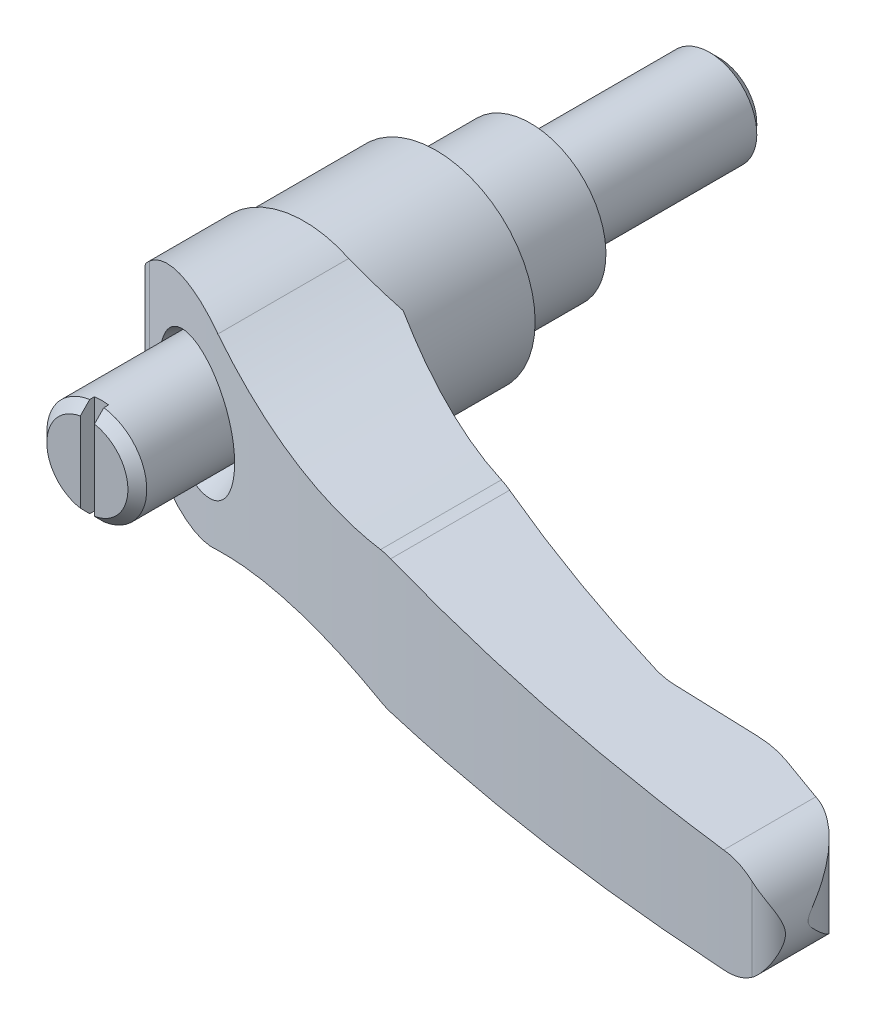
ISO-10303-21;
HEADER;
FILE_DESCRIPTION(('STEP AP214'),'2;1');
FILE_NAME('part.step','',(''),(''),'','','');
FILE_SCHEMA(('AUTOMOTIVE_DESIGN { 1 0 10303 214 1 1 1 1 }'));
ENDSEC;
DATA;
#1=APPLICATION_CONTEXT('core data for automotive mechanical design processes');
#2=APPLICATION_PROTOCOL_DEFINITION('international standard','automotive_design',2000,#1);
#3=PRODUCT_CONTEXT('',#1,'mechanical');
#4=PRODUCT('Part','Part','',(#3));
#5=PRODUCT_RELATED_PRODUCT_CATEGORY('part','',(#4));
#6=PRODUCT_DEFINITION_FORMATION('','',#4);
#7=PRODUCT_DEFINITION_CONTEXT('part definition',#1,'design');
#8=PRODUCT_DEFINITION('design','',#6,#7);
#9=PRODUCT_DEFINITION_SHAPE('','',#8);
#10=(LENGTH_UNIT() NAMED_UNIT(*) SI_UNIT(.MILLI.,.METRE.));
#11=(NAMED_UNIT(*) PLANE_ANGLE_UNIT() SI_UNIT($,.RADIAN.));
#12=(NAMED_UNIT(*) SI_UNIT($,.STERADIAN.) SOLID_ANGLE_UNIT());
#13=UNCERTAINTY_MEASURE_WITH_UNIT(LENGTH_MEASURE(1.E-05),#10,'distance_accuracy_value','');
#14=(GEOMETRIC_REPRESENTATION_CONTEXT(3) GLOBAL_UNCERTAINTY_ASSIGNED_CONTEXT((#13)) GLOBAL_UNIT_ASSIGNED_CONTEXT((#10,
#11,#12)) REPRESENTATION_CONTEXT('',''));
#15=CARTESIAN_POINT('',(0.,0.,0.));
#16=DIRECTION('',(0.,0.,1.));
#17=DIRECTION('',(1.,0.,0.));
#18=AXIS2_PLACEMENT_3D('',#15,#16,#17);
#19=CARTESIAN_POINT('',(-0.010000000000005,0.,27.8125));
#20=DIRECTION('',(0.,0.,-1.));
#21=DIRECTION('',(1.,0.,0.));
#22=AXIS2_PLACEMENT_3D('',#19,#20,#21);
#23=CYLINDRICAL_SURFACE('',#22,10.5);
#24=CARTESIAN_POINT('',(-0.0100000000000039,0.,24.));
#25=DIRECTION('',(0.,0.,1.));
#26=DIRECTION('',(0.,-1.,0.));
#27=AXIS2_PLACEMENT_3D('',#24,#25,#26);
#28=CIRCLE('',#27,10.5);
#29=CARTESIAN_POINT('',(-10.51,0.,24.));
#30=VERTEX_POINT('',#29);
#31=CARTESIAN_POINT('',(10.49,0.,24.));
#32=VERTEX_POINT('',#31);
#33=EDGE_CURVE('E571',#30,#32,#28,.T.);
#34=ORIENTED_EDGE('',*,*,#33,.F.);
#35=EDGE_CURVE('E575',#32,#30,#28,.T.);
#36=ORIENTED_EDGE('',*,*,#35,.F.);
#37=EDGE_LOOP('',(#34,#36));
#38=FACE_BOUND('',#37,.T.);
#39=CARTESIAN_POINT('',(-0.00999999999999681,0.,-0.250037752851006));
#40=DIRECTION('',(0.707106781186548,0.,0.707106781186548));
#41=DIRECTION('',(0.707106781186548,0.,-0.707106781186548));
#42=AXIS2_PLACEMENT_3D('',#39,#40,#41);
#43=ELLIPSE('',#42,14.8492424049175,10.5);
#44=CARTESIAN_POINT('',(-10.260037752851,-2.27743848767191,10.));
#45=VERTEX_POINT('',#44);
#46=CARTESIAN_POINT('',(-10.260037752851,2.27743848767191,10.));
#47=VERTEX_POINT('',#46);
#48=EDGE_CURVE('E294',#45,#47,#43,.F.);
#49=ORIENTED_EDGE('',*,*,#48,.F.);
#50=CARTESIAN_POINT('',(-0.0099999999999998,0.,10.));
#51=DIRECTION('',(0.,0.,-1.));
#52=DIRECTION('',(1.,0.,0.));
#53=AXIS2_PLACEMENT_3D('',#50,#51,#52);
#54=CIRCLE('',#53,10.5);
#55=EDGE_CURVE('E176',#47,#45,#54,.T.);
#56=ORIENTED_EDGE('',*,*,#55,.F.);
#57=EDGE_LOOP('',(#49,#56));
#58=FACE_BOUND('',#57,.T.);
#59=ADVANCED_FACE('F14',(#38,#58),#23,.T.);
#60=CARTESIAN_POINT('',(57.3760512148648,-12.,33.4699999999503));
#61=DIRECTION('',(0.,1.,0.));
#62=DIRECTION('',(-1.,0.,0.));
#63=AXIS2_PLACEMENT_3D('',#60,#61,#62);
#64=CYLINDRICAL_SURFACE('',#63,8.59000000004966);
#65=CARTESIAN_POINT('',(57.3760512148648,6.11892873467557,33.4699999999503));
#66=DIRECTION('',(0.0361204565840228,0.999347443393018,0.));
#67=DIRECTION('',(-0.999347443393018,0.0361204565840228,0.));
#68=AXIS2_PLACEMENT_3D('',#65,#66,#67);
#69=ELLIPSE('',#68,8.59560912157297,8.59000000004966);
#70=CARTESIAN_POINT('',(57.37605121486,6.11892873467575,42.06));
#71=VERTEX_POINT('',#70);
#72=CARTESIAN_POINT('',(55.1138126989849,6.20069518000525,41.7567591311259));
#73=VERTEX_POINT('',#72);
#74=EDGE_CURVE('E1126',#71,#73,#69,.F.);
#75=ORIENTED_EDGE('',*,*,#74,.F.);
#76=DIRECTION('',(0.,1.,0.));
#77=VECTOR('',#76,1.);
#78=CARTESIAN_POINT('',(57.37605121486,-12.,42.06));
#79=LINE('',#78,#77);
#80=CARTESIAN_POINT('',(57.37605121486,-6.11892873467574,42.06));
#81=VERTEX_POINT('',#80);
#82=EDGE_CURVE('E598',#81,#71,#79,.T.);
#83=ORIENTED_EDGE('',*,*,#82,.F.);
#84=CARTESIAN_POINT('',(57.3760512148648,-6.11892873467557,33.4699999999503));
#85=DIRECTION('',(0.0361204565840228,-0.999347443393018,0.));
#86=DIRECTION('',(0.999347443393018,0.0361204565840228,0.));
#87=AXIS2_PLACEMENT_3D('',#84,#85,#86);
#88=ELLIPSE('',#87,8.59560912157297,8.59000000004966);
#89=CARTESIAN_POINT('',(55.1138126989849,-6.20069518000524,41.7567591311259));
#90=VERTEX_POINT('',#89);
#91=EDGE_CURVE('E1119',#90,#81,#88,.F.);
#92=ORIENTED_EDGE('',*,*,#91,.F.);
#93=DIRECTION('',(0.,1.,0.));
#94=VECTOR('',#93,1.);
#95=CARTESIAN_POINT('',(55.1138126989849,-12.,41.7567591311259));
#96=LINE('',#95,#94);
#97=EDGE_CURVE('E601',#90,#73,#96,.T.);
#98=ORIENTED_EDGE('',*,*,#97,.T.);
#99=EDGE_LOOP('',(#75,#83,#92,#98));
#100=FACE_BOUND('',#99,.T.);
#101=ADVANCED_FACE('F384',(#100),#64,.F.);
#102=CARTESIAN_POINT('',(57.37605121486,-12.,42.06));
#103=DIRECTION('',(0.,0.,1.));
#104=DIRECTION('',(0.,-1.,0.));
#105=AXIS2_PLACEMENT_3D('',#102,#103,#104);
#106=PLANE('',#105);
#107=DIRECTION('',(-0.999347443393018,0.0361204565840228,0.));
#108=VECTOR('',#107,1.);
#109=CARTESIAN_POINT('',(58.0300881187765,6.09528919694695,42.06));
#110=LINE('',#109,#108);
#111=CARTESIAN_POINT('',(66.163324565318,5.80132115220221,42.06));
#112=VERTEX_POINT('',#111);
#113=EDGE_CURVE('E1127',#112,#71,#110,.T.);
#114=ORIENTED_EDGE('',*,*,#113,.F.);
#115=DIRECTION('',(0.,1.,0.));
#116=VECTOR('',#115,1.);
#117=CARTESIAN_POINT('',(66.163324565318,-12.,42.06));
#118=LINE('',#117,#116);
#119=CARTESIAN_POINT('',(66.163324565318,-5.80132115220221,42.06));
#120=VERTEX_POINT('',#119);
#121=EDGE_CURVE('E595',#120,#112,#118,.T.);
#122=ORIENTED_EDGE('',*,*,#121,.F.);
#123=DIRECTION('',(0.999347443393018,0.0361204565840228,0.));
#124=VECTOR('',#123,1.);
#125=CARTESIAN_POINT('',(57.1637628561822,-6.12660169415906,42.06));
#126=LINE('',#125,#124);
#127=EDGE_CURVE('E1124',#81,#120,#126,.T.);
#128=ORIENTED_EDGE('',*,*,#127,.F.);
#129=ORIENTED_EDGE('',*,*,#82,.T.);
#130=EDGE_LOOP('',(#114,#122,#128,#129));
#131=FACE_BOUND('',#130,.T.);
#132=ADVANCED_FACE('F523',(#131),#106,.F.);
#133=CARTESIAN_POINT('',(66.1633245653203,-12.,53.3399999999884));
#134=DIRECTION('',(0.,1.,0.));
#135=DIRECTION('',(-1.,0.,0.));
#136=AXIS2_PLACEMENT_3D('',#133,#134,#135);
#137=CYLINDRICAL_SURFACE('',#136,11.2799999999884);
#138=CARTESIAN_POINT('',(66.1633245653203,5.80132115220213,53.3399999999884));
#139=DIRECTION('',(0.0361204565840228,0.999347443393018,0.));
#140=DIRECTION('',(-0.999347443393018,0.0361204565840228,0.));
#141=AXIS2_PLACEMENT_3D('',#138,#139,#140);
#142=ELLIPSE('',#141,11.2873656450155,11.2799999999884);
#143=CARTESIAN_POINT('',(69.761185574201,5.6712799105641,42.649172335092));
#144=VERTEX_POINT('',#143);
#145=EDGE_CURVE('E1128',#144,#112,#142,.T.);
#146=ORIENTED_EDGE('',*,*,#145,.F.);
#147=DIRECTION('',(0.,1.,0.));
#148=VECTOR('',#147,1.);
#149=CARTESIAN_POINT('',(69.761185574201,-12.,42.649172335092));
#150=LINE('',#149,#148);
#151=CARTESIAN_POINT('',(69.761185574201,-5.6712799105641,42.649172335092));
#152=VERTEX_POINT('',#151);
#153=EDGE_CURVE('E592',#152,#144,#150,.T.);
#154=ORIENTED_EDGE('',*,*,#153,.F.);
#155=CARTESIAN_POINT('',(66.1633245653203,-5.80132115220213,53.3399999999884));
#156=DIRECTION('',(0.0361204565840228,-0.999347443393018,0.));
#157=DIRECTION('',(0.999347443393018,0.0361204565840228,0.));
#158=AXIS2_PLACEMENT_3D('',#155,#156,#157);
#159=ELLIPSE('',#158,11.2873656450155,11.2799999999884);
#160=EDGE_CURVE('E1149',#120,#152,#159,.T.);
#161=ORIENTED_EDGE('',*,*,#160,.F.);
#162=ORIENTED_EDGE('',*,*,#121,.T.);
#163=EDGE_LOOP('',(#146,#154,#161,#162));
#164=FACE_BOUND('',#163,.T.);
#165=ADVANCED_FACE('F424',(#164),#137,.T.);
#166=CARTESIAN_POINT('',(111.590768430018,-12.,-165.122809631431));
#167=DIRECTION('',(0.,1.,0.));
#168=DIRECTION('',(-1.,0.,0.));
#169=AXIS2_PLACEMENT_3D('',#166,#167,#168);
#170=CYLINDRICAL_SURFACE('',#169,214.450000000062);
#171=CARTESIAN_POINT('',(30.179428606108,-6.9666323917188,33.2732494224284));
#172=CARTESIAN_POINT('',(30.4222007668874,-7.0028281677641,33.3728739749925));
#173=CARTESIAN_POINT('',(30.6665043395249,-7.02781937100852,33.472598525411));
#174=CARTESIAN_POINT('',(31.033921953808,-7.04840105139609,33.6217860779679));
#175=CARTESIAN_POINT('',(31.1565128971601,-7.05244559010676,33.6714318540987));
#176=CARTESIAN_POINT('',(31.4020580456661,-7.05489552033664,33.7706062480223));
#177=CARTESIAN_POINT('',(31.5250125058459,-7.05329063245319,33.820134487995));
#178=CARTESIAN_POINT('',(31.647932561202,-7.0488469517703,33.8695155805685));
#179=B_SPLINE_CURVE_WITH_KNOTS('',3,(#171,#172,#173,#174,#175,#176,#177,#178),.UNSPECIFIED.,.F.,
.F.,(4,2,2,4),(0.,0.794258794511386,1.19111760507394,1.58869889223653),.UNSPECIFIED.);
#180=CARTESIAN_POINT('',(30.179428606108,-6.9666323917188,33.2732494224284));
#181=VERTEX_POINT('',#180);
#182=CARTESIAN_POINT('',(31.647932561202,-7.0488469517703,33.8695155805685));
#183=VERTEX_POINT('',#182);
#184=EDGE_CURVE('E440',#181,#183,#179,.T.);
#185=ORIENTED_EDGE('',*,*,#184,.F.);
#186=CARTESIAN_POINT('',(10.49,-8.03465812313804,24.));
#187=CARTESIAN_POINT('',(11.2781269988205,-7.82806345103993,24.4213315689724));
#188=CARTESIAN_POINT('',(12.0728488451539,-7.64070973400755,24.8398212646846));
#189=CARTESIAN_POINT('',(13.6740672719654,-7.30530099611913,25.6700985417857));
#190=CARTESIAN_POINT('',(14.4805646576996,-7.15724867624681,26.0818856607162));
#191=CARTESIAN_POINT('',(16.0966341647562,-6.90241973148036,26.8940746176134));
#192=CARTESIAN_POINT('',(16.906116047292,-6.79528972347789,27.2945449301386));
#193=CARTESIAN_POINT('',(18.5335723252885,-6.62127786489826,28.0868684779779));
#194=CARTESIAN_POINT('',(19.3515465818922,-6.55439535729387,28.4787218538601));
#195=CARTESIAN_POINT('',(20.9944633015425,-6.46166065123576,29.2529521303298));
#196=CARTESIAN_POINT('',(21.8194069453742,-6.43581555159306,29.6353273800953));
#197=CARTESIAN_POINT('',(23.474294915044,-6.42593469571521,30.3896366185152));
#198=CARTESIAN_POINT('',(24.3042391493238,-6.44189817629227,30.7615707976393));
#199=CARTESIAN_POINT('',(25.974600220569,-6.51667337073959,31.497417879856));
#200=CARTESIAN_POINT('',(26.8150445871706,-6.57586454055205,31.8612301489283));
#201=CARTESIAN_POINT('',(28.4970001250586,-6.7381558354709,32.5766232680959));
#202=CARTESIAN_POINT('',(29.3385114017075,-6.84126069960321,32.9282027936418));
#203=CARTESIAN_POINT('',(30.179428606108,-6.96663239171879,33.2732494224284));
#204=B_SPLINE_CURVE_WITH_KNOTS('',3,(#186,#187,#188,#189,#190,#191,#192,#193,#194,#195,#196,
#197,#198,#199,#200,#201,#202,#203),.UNSPECIFIED.,.F.,.F.,(4,2,2,2,2,2,2,2,4),(0.,
2.7515590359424,5.50330712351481,8.23072437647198,10.9580971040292,13.6859415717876,
16.4137362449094,19.1657679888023,21.9180967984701),.UNSPECIFIED.);
#205=CARTESIAN_POINT('',(10.49,-8.03465812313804,24.));
#206=VERTEX_POINT('',#205);
#207=EDGE_CURVE('E431',#206,#181,#204,.T.);
#208=ORIENTED_EDGE('',*,*,#207,.F.);
#209=DIRECTION('',(0.,1.,0.));
#210=VECTOR('',#209,1.);
#211=CARTESIAN_POINT('',(10.49,-12.,24.));
#212=LINE('',#211,#210);
#213=EDGE_CURVE('E605',#206,#32,#212,.T.);
#214=ORIENTED_EDGE('',*,*,#213,.T.);
#215=CARTESIAN_POINT('',(10.49,8.03465812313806,24.));
#216=VERTEX_POINT('',#215);
#217=EDGE_CURVE('E604',#32,#216,#212,.T.);
#218=ORIENTED_EDGE('',*,*,#217,.T.);
#219=CARTESIAN_POINT('',(30.179428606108,6.9666323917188,33.2732494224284));
#220=CARTESIAN_POINT('',(29.3385114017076,6.84126069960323,32.9282027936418));
#221=CARTESIAN_POINT('',(28.4970001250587,6.73815583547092,32.5766232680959));
#222=CARTESIAN_POINT('',(26.8150445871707,6.57586454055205,31.8612301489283));
#223=CARTESIAN_POINT('',(25.974600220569,6.51667337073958,31.497417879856));
#224=CARTESIAN_POINT('',(24.3042391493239,6.44189817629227,30.7615707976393));
#225=CARTESIAN_POINT('',(23.4742949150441,6.42593469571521,30.3896366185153));
#226=CARTESIAN_POINT('',(21.8194069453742,6.43581555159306,29.6353273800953));
#227=CARTESIAN_POINT('',(20.9944633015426,6.46166065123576,29.2529521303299));
#228=CARTESIAN_POINT('',(19.3515465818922,6.55439535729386,28.4787218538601));
#229=CARTESIAN_POINT('',(18.5335723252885,6.62127786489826,28.0868684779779));
#230=CARTESIAN_POINT('',(16.906116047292,6.79528972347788,27.2945449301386));
#231=CARTESIAN_POINT('',(16.0966341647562,6.90241973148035,26.8940746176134));
#232=CARTESIAN_POINT('',(14.4805646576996,7.15724867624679,26.0818856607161));
#233=CARTESIAN_POINT('',(13.6740672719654,7.30530099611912,25.6700985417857));
#234=CARTESIAN_POINT('',(12.0728488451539,7.64070973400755,24.8398212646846));
#235=CARTESIAN_POINT('',(11.2781269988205,7.82806345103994,24.4213315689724));
#236=CARTESIAN_POINT('',(10.49,8.03465812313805,24.));
#237=B_SPLINE_CURVE_WITH_KNOTS('',3,(#219,#220,#221,#222,#223,#224,#225,#226,#227,#228,#229,
#230,#231,#232,#233,#234,#235,#236),.UNSPECIFIED.,.F.,.F.,(4,2,2,2,2,2,2,2,4),(0.,
2.75232880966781,5.50436055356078,8.23215522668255,10.9599996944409,13.6873724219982,
16.4147896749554,19.1665377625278,21.9180967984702),.UNSPECIFIED.);
#238=CARTESIAN_POINT('',(30.179428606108,6.9666323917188,33.2732494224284));
#239=VERTEX_POINT('',#238);
#240=EDGE_CURVE('E411',#239,#216,#237,.T.);
#241=ORIENTED_EDGE('',*,*,#240,.F.);
#242=CARTESIAN_POINT('',(31.647932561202,7.0488469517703,33.8695155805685));
#243=CARTESIAN_POINT('',(31.5250125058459,7.05329063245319,33.820134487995));
#244=CARTESIAN_POINT('',(31.4020580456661,7.05489552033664,33.7706062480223));
#245=CARTESIAN_POINT('',(31.1565128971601,7.05244559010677,33.6714318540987));
#246=CARTESIAN_POINT('',(31.033921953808,7.04840105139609,33.6217860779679));
#247=CARTESIAN_POINT('',(30.666504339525,7.02781937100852,33.472598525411));
#248=CARTESIAN_POINT('',(30.4222007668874,7.0028281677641,33.3728739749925));
#249=CARTESIAN_POINT('',(30.179428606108,6.9666323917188,33.2732494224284));
#250=B_SPLINE_CURVE_WITH_KNOTS('',3,(#242,#243,#244,#245,#246,#247,#248,#249),.UNSPECIFIED.,.F.,
.F.,(4,2,2,4),(0.,0.39758128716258,0.794440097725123,1.58869889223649),.UNSPECIFIED.);
#251=CARTESIAN_POINT('',(31.647932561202,7.0488469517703,33.8695155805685));
#252=VERTEX_POINT('',#251);
#253=EDGE_CURVE('E403',#252,#239,#250,.T.);
#254=ORIENTED_EDGE('',*,*,#253,.F.);
#255=CARTESIAN_POINT('',(111.590768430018,4.15938968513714,-165.122809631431));
#256=DIRECTION('',(0.0361204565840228,0.999347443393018,0.));
#257=DIRECTION('',(-0.999347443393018,0.0361204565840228,0.));
#258=AXIS2_PLACEMENT_3D('',#255,#256,#257);
#259=ELLIPSE('',#258,214.590032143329,214.450000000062);
#260=EDGE_CURVE('E412',#73,#252,#259,.F.);
#261=ORIENTED_EDGE('',*,*,#260,.F.);
#262=ORIENTED_EDGE('',*,*,#97,.F.);
#263=CARTESIAN_POINT('',(111.590768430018,-4.15938968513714,-165.122809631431));
#264=DIRECTION('',(0.0361204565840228,-0.999347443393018,0.));
#265=DIRECTION('',(0.999347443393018,0.0361204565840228,0.));
#266=AXIS2_PLACEMENT_3D('',#263,#264,#265);
#267=ELLIPSE('',#266,214.590032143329,214.450000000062);
#268=EDGE_CURVE('E1117',#183,#90,#267,.F.);
#269=ORIENTED_EDGE('',*,*,#268,.F.);
#270=EDGE_LOOP('',(#185,#208,#214,#218,#241,#254,#261,#262,#269));
#271=FACE_BOUND('',#270,.T.);
#272=ADVANCED_FACE('F419',(#271),#170,.F.);
#273=CARTESIAN_POINT('',(79.996705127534,-12.,50.539592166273));
#274=DIRECTION('',(-0.99233193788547,0.,0.123601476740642));
#275=DIRECTION('',(-0.123601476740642,0.,-0.99233193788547));
#276=AXIS2_PLACEMENT_3D('',#273,#274,#275);
#277=PLANE('',#276);
#278=CARTESIAN_POINT('',(74.5,0.,6.40940703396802));
#279=DIRECTION('',(-0.99233193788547,0.,0.123601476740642));
#280=DIRECTION('',(0.123601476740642,0.,0.99233193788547));
#281=AXIS2_PLACEMENT_3D('',#278,#279,#280);
#282=ELLIPSE('',#281,44.4978502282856,5.5);
#283=CARTESIAN_POINT('',(79.996705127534,-0.190348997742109,50.539592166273));
#284=VERTEX_POINT('',#283);
#285=CARTESIAN_POINT('',(79.996705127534,0.190348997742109,50.539592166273));
#286=VERTEX_POINT('',#285);
#287=EDGE_CURVE('E505',#284,#286,#282,.T.);
#288=ORIENTED_EDGE('',*,*,#287,.F.);
#289=DIRECTION('',(0.,1.,0.));
#290=VECTOR('',#289,1.);
#291=CARTESIAN_POINT('',(79.996705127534,-12.,50.539592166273));
#292=LINE('',#291,#290);
#293=EDGE_CURVE('E586',#284,#286,#292,.T.);
#294=ORIENTED_EDGE('',*,*,#293,.T.);
#295=EDGE_LOOP('',(#288,#294));
#296=FACE_BOUND('',#295,.T.);
#297=ADVANCED_FACE('F423',(#296),#277,.F.);
#298=CARTESIAN_POINT('',(72.6137555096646,-12.,51.4591871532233));
#299=DIRECTION('',(0.,1.,0.));
#300=DIRECTION('',(-1.,0.,0.));
#301=AXIS2_PLACEMENT_3D('',#298,#299,#300);
#302=CYLINDRICAL_SURFACE('',#301,7.44000000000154);
#303=CARTESIAN_POINT('',(74.986812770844,-5.47841339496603,44.407790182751));
#304=CARTESIAN_POINT('',(75.1398120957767,-5.4648402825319,44.4592429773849));
#305=CARTESIAN_POINT('',(75.2905169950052,-5.44496899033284,44.5155387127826));
#306=CARTESIAN_POINT('',(75.5860882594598,-5.39377415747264,44.6368581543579));
#307=CARTESIAN_POINT('',(75.730963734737,-5.36246932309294,44.7018674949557));
#308=CARTESIAN_POINT('',(76.0125967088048,-5.2898955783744,44.839081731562));
#309=CARTESIAN_POINT('',(76.149425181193,-5.248738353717,44.9112009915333));
#310=CARTESIAN_POINT('',(76.4161065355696,-5.1573648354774,45.062373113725));
#311=CARTESIAN_POINT('',(76.5459558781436,-5.10714400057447,45.1414294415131));
#312=CARTESIAN_POINT('',(76.827653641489,-4.98604991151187,45.3247681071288));
#313=CARTESIAN_POINT('',(76.9775772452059,-4.91309116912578,45.4306358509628));
#314=CARTESIAN_POINT('',(77.2657899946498,-4.75681575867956,45.6501400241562));
#315=CARTESIAN_POINT('',(77.4040776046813,-4.67349772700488,45.7637774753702));
#316=CARTESIAN_POINT('',(77.8028296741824,-4.40945601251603,46.1156758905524));
#317=CARTESIAN_POINT('',(78.0457801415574,-4.21527563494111,46.3639882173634));
#318=CARTESIAN_POINT('',(78.4176945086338,-3.86589184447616,46.7984433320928));
#319=CARTESIAN_POINT('',(78.558647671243,-3.71726415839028,46.9799982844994));
#320=CARTESIAN_POINT('',(78.8199419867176,-3.41009407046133,47.3496806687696));
#321=CARTESIAN_POINT('',(78.9402736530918,-3.25154715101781,47.5378110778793));
#322=CARTESIAN_POINT('',(79.1607378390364,-2.92676895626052,47.9181651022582));
#323=CARTESIAN_POINT('',(79.2609186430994,-2.76055725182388,48.1103776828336));
#324=CARTESIAN_POINT('',(79.4421677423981,-2.42115236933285,48.497428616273));
#325=CARTESIAN_POINT('',(79.5232445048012,-2.24796232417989,48.6922657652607));
#326=CARTESIAN_POINT('',(79.657896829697,-1.91676087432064,49.0578102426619));
#327=CARTESIAN_POINT('',(79.713648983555,-1.75958096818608,49.2284695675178));
#328=CARTESIAN_POINT('',(79.7869638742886,-1.51825146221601,49.4826945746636));
#329=CARTESIAN_POINT('',(79.8097141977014,-1.43673320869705,49.5672896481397));
#330=CARTESIAN_POINT('',(79.8517302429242,-1.27132927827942,49.7350141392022));
#331=CARTESIAN_POINT('',(79.8709966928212,-1.18744410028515,49.8181438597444));
#332=CARTESIAN_POINT('',(79.907186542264,-1.01046435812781,49.986973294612));
#333=CARTESIAN_POINT('',(79.9238666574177,-0.917129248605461,50.0724723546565));
#334=CARTESIAN_POINT('',(79.9529450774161,-0.724505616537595,50.2358460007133));
#335=CARTESIAN_POINT('',(79.9653823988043,-0.625281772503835,50.3137850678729));
#336=CARTESIAN_POINT('',(79.9802376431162,-0.46858024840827,50.4153149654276));
#337=CARTESIAN_POINT('',(79.9845030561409,-0.416215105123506,50.4460963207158));
#338=CARTESIAN_POINT('',(79.9917045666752,-0.306879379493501,50.4998809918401));
#339=CARTESIAN_POINT('',(79.9946243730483,-0.249861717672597,50.522788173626));
#340=CARTESIAN_POINT('',(79.996705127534,-0.190348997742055,50.539592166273));
#341=B_SPLINE_CURVE_WITH_KNOTS('',3,(#303,#304,#305,#306,#307,#308,#309,#310,#311,#312,#313,
#314,#315,#316,#317,#318,#319,#320,#321,#322,#323,#324,#325,#326,#327,#328,#329,#330,#331,#332,
#333,#334,#335,#336,#337,#338,#339,#340),.UNSPECIFIED.,.F.,.F.,(4,2,2,2,2,2,2,2,2,2,2,2,2,2,2,2,
2,2,4),(0.,0.485611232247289,0.970431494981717,1.44999646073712,1.92980238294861,
2.52141817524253,3.11311192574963,4.30183389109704,5.12208341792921,5.94270927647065,
6.76134473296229,7.57961667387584,8.29494630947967,8.65387747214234,9.01273353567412,
9.39561932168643,9.77488268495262,9.95698827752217,10.1412441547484),.UNSPECIFIED.);
#342=CARTESIAN_POINT('',(74.986812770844,-5.47841339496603,44.407790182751));
#343=VERTEX_POINT('',#342);
#344=EDGE_CURVE('E504',#343,#284,#341,.T.);
#345=ORIENTED_EDGE('',*,*,#344,.F.);
#346=DIRECTION('',(0.,1.,0.));
#347=VECTOR('',#346,1.);
#348=CARTESIAN_POINT('',(74.986812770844,-12.,44.407790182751));
#349=LINE('',#348,#347);
#350=CARTESIAN_POINT('',(74.986812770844,5.47841339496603,44.407790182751));
#351=VERTEX_POINT('',#350);
#352=EDGE_CURVE('E589',#343,#351,#349,.T.);
#353=ORIENTED_EDGE('',*,*,#352,.T.);
#354=CARTESIAN_POINT('',(79.996705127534,0.190348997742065,50.539592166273));
#355=CARTESIAN_POINT('',(79.9951469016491,0.235214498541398,50.5270575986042));
#356=CARTESIAN_POINT('',(79.9930953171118,0.278736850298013,50.5108629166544));
#357=CARTESIAN_POINT('',(79.9881648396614,0.363077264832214,50.47327081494));
#358=CARTESIAN_POINT('',(79.9852922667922,0.403913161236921,50.451913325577));
#359=CARTESIAN_POINT('',(79.9757020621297,0.522458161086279,50.3833482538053));
#360=CARTESIAN_POINT('',(79.9679715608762,0.597169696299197,50.3312876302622));
#361=CARTESIAN_POINT('',(79.950886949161,0.736456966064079,50.225155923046));
#362=CARTESIAN_POINT('',(79.9416856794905,0.801375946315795,50.1714851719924));
#363=CARTESIAN_POINT('',(79.9214540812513,0.928420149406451,50.0612288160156));
#364=CARTESIAN_POINT('',(79.9104232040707,0.990544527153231,50.0046423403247));
#365=CARTESIAN_POINT('',(79.8746515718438,1.17419942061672,49.832312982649));
#366=CARTESIAN_POINT('',(79.847248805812,1.29287988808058,49.7141099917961));
#367=CARTESIAN_POINT('',(79.7848398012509,1.52823594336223,49.4729704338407));
#368=CARTESIAN_POINT('',(79.749692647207,1.64482416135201,49.3499864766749));
#369=CARTESIAN_POINT('',(79.6721004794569,1.8745831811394,49.1033284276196));
#370=CARTESIAN_POINT('',(79.6296610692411,1.98775652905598,48.9796549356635));
#371=CARTESIAN_POINT('',(79.5033816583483,2.29352791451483,48.641550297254));
#372=CARTESIAN_POINT('',(79.4120558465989,2.48329449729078,48.4272966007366));
#373=CARTESIAN_POINT('',(79.2061355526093,2.85434488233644,48.0023120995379));
#374=CARTESIAN_POINT('',(79.0915236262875,3.03562219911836,47.791584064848));
#375=CARTESIAN_POINT('',(78.8390032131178,3.38665877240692,47.3777391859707));
#376=CARTESIAN_POINT('',(78.7012752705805,3.5564939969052,47.174577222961));
#377=CARTESIAN_POINT('',(78.4009143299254,3.88356808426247,46.7768350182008));
#378=CARTESIAN_POINT('',(78.2383021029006,4.04081728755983,46.5822477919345));
#379=CARTESIAN_POINT('',(77.9568022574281,4.28016983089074,46.2794503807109));
#380=CARTESIAN_POINT('',(77.8461272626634,4.36735584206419,46.1675710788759));
#381=CARTESIAN_POINT('',(77.615129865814,4.53501217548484,45.9487274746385));
#382=CARTESIAN_POINT('',(77.4948054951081,4.61548112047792,45.8417641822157));
#383=CARTESIAN_POINT('',(77.2447591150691,4.76840923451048,45.633916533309));
#384=CARTESIAN_POINT('',(77.1150589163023,4.84088606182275,45.5330190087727));
#385=CARTESIAN_POINT('',(76.846172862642,4.97676025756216,45.3380932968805));
#386=CARTESIAN_POINT('',(76.7069926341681,5.04016294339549,45.2440611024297));
#387=CARTESIAN_POINT('',(76.4438690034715,5.14664435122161,45.079244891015));
#388=CARTESIAN_POINT('',(76.3213555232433,5.19134589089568,45.0072256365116));
#389=CARTESIAN_POINT('',(76.0703754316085,5.27269544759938,44.8693561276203));
#390=CARTESIAN_POINT('',(75.9419112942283,5.30934677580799,44.803503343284));
#391=CARTESIAN_POINT('',(75.6784961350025,5.3739797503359,44.6781572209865));
#392=CARTESIAN_POINT('',(75.5435027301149,5.40189236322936,44.618716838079));
#393=CARTESIAN_POINT('',(75.268600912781,5.44782102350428,44.5073869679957));
#394=CARTESIAN_POINT('',(75.1286862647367,5.46582399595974,44.4555075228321));
#395=CARTESIAN_POINT('',(74.986812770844,5.47841339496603,44.407790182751));
#396=B_SPLINE_CURVE_WITH_KNOTS('',3,(#354,#355,#356,#357,#358,#359,#360,#361,#362,#363,#364,
#365,#366,#367,#368,#369,#370,#371,#372,#373,#374,#375,#376,#377,#378,#379,#380,#381,#382,#383,
#384,#385,#386,#387,#388,#389,#390,#391,#392,#393,#394,#395),.UNSPECIFIED.,.F.,.F.,(4,2,2,2,2,2,
2,2,2,2,2,2,2,2,2,2,2,2,2,2,4),(0.,0.139245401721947,0.277446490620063,0.550810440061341,
0.804906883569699,1.05907965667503,1.56794086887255,2.08696422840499,2.60559053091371,
3.50582150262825,4.4067293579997,5.30090298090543,6.19433426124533,6.73367946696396,
7.27313498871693,7.81137365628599,8.34929561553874,8.7958064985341,9.24213337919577,
9.69190199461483,10.1422626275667),.UNSPECIFIED.);
#397=EDGE_CURVE('E498',#286,#351,#396,.T.);
#398=ORIENTED_EDGE('',*,*,#397,.F.);
#399=ORIENTED_EDGE('',*,*,#293,.F.);
#400=EDGE_LOOP('',(#345,#353,#398,#399));
#401=FACE_BOUND('',#400,.T.);
#402=ADVANCED_FACE('F511',(#401),#302,.T.);
#403=CARTESIAN_POINT('',(69.761185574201,-12.,42.649172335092));
#404=DIRECTION('',(-0.318959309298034,0.,0.947768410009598));
#405=DIRECTION('',(-0.947768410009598,0.,-0.318959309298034));
#406=AXIS2_PLACEMENT_3D('',#403,#404,#405);
#407=PLANE('',#406);
#408=DIRECTION('',(-0.947212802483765,0.0342360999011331,-0.318772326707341));
#409=VECTOR('',#408,1.);
#410=CARTESIAN_POINT('',(70.3342452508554,5.65056721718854,42.8420282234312));
#411=LINE('',#410,#409);
#412=CARTESIAN_POINT('',(74.5,5.5,44.2439595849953));
#413=VERTEX_POINT('',#412);
#414=EDGE_CURVE('E1132',#413,#144,#411,.T.);
#415=ORIENTED_EDGE('',*,*,#414,.F.);
#416=CARTESIAN_POINT('',(74.5,0.,44.2439595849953));
#417=DIRECTION('',(-0.318959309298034,0.,0.947768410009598));
#418=DIRECTION('',(0.947768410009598,0.,0.318959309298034));
#419=AXIS2_PLACEMENT_3D('',#416,#417,#418);
#420=ELLIPSE('',#419,5.80310542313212,5.5);
#421=EDGE_CURVE('E1133',#351,#413,#420,.T.);
#422=ORIENTED_EDGE('',*,*,#421,.F.);
#423=ORIENTED_EDGE('',*,*,#352,.F.);
#424=CARTESIAN_POINT('',(74.5,-5.5,44.2439595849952));
#425=VERTEX_POINT('',#424);
#426=EDGE_CURVE('E1134',#425,#343,#420,.T.);
#427=ORIENTED_EDGE('',*,*,#426,.F.);
#428=DIRECTION('',(0.947212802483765,0.0342360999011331,0.318772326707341));
#429=VECTOR('',#428,1.);
#430=CARTESIAN_POINT('',(69.5559523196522,-5.6786978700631,42.5801037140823));
#431=LINE('',#430,#429);
#432=EDGE_CURVE('E446',#152,#425,#431,.T.);
#433=ORIENTED_EDGE('',*,*,#432,.F.);
#434=ORIENTED_EDGE('',*,*,#153,.T.);
#435=EDGE_LOOP('',(#415,#422,#423,#427,#433,#434));
#436=FACE_BOUND('',#435,.T.);
#437=ADVANCED_FACE('F516',(#436),#407,.F.);
#438=CARTESIAN_POINT('',(-10.51,-12.,24.));
#439=DIRECTION('',(0.,0.,1.));
#440=DIRECTION('',(0.,-1.,0.));
#441=AXIS2_PLACEMENT_3D('',#438,#439,#440);
#442=PLANE('',#441);
#443=CARTESIAN_POINT('',(22.94,55.5300000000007,24.));
#444=DIRECTION('',(0.,0.,1.));
#445=DIRECTION('',(0.,-1.,0.));
#446=AXIS2_PLACEMENT_3D('',#443,#444,#445);
#447=CIRCLE('',#446,49.1000000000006);
#448=CARTESIAN_POINT('',(4.7225102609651,9.9346815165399,24.));
#449=VERTEX_POINT('',#448);
#450=EDGE_CURVE('E572',#216,#449,#447,.F.);
#451=ORIENTED_EDGE('',*,*,#450,.F.);
#452=ORIENTED_EDGE('',*,*,#217,.F.);
#453=ORIENTED_EDGE('',*,*,#35,.T.);
#454=DIRECTION('',(0.,1.,0.));
#455=VECTOR('',#454,1.);
#456=CARTESIAN_POINT('',(-10.51,-12.,24.));
#457=LINE('',#456,#455);
#458=CARTESIAN_POINT('',(-10.51,3.24652121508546,24.));
#459=VERTEX_POINT('',#458);
#460=EDGE_CURVE('E606',#30,#459,#457,.T.);
#461=ORIENTED_EDGE('',*,*,#460,.T.);
#462=CARTESIAN_POINT('',(0.,0.,24.));
#463=DIRECTION('',(0.,0.,1.));
#464=DIRECTION('',(0.,-1.,0.));
#465=AXIS2_PLACEMENT_3D('',#462,#463,#464);
#466=CIRCLE('',#465,11.);
#467=EDGE_CURVE('E618',#449,#459,#466,.T.);
#468=ORIENTED_EDGE('',*,*,#467,.F.);
#469=EDGE_LOOP('',(#451,#452,#453,#461,#468));
#470=FACE_BOUND('',#469,.T.);
#471=ADVANCED_FACE('F427',(#470),#442,.F.);
#472=CARTESIAN_POINT('',(22.94,-55.5300000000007,24.));
#473=DIRECTION('',(0.,0.,1.));
#474=DIRECTION('',(0.,-1.,0.));
#475=AXIS2_PLACEMENT_3D('',#472,#473,#474);
#476=CIRCLE('',#475,49.1000000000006);
#477=CARTESIAN_POINT('',(4.7225102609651,-9.9346815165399,24.));
#478=VERTEX_POINT('',#477);
#479=EDGE_CURVE('E447',#478,#206,#476,.F.);
#480=ORIENTED_EDGE('',*,*,#479,.F.);
#481=CARTESIAN_POINT('',(0.,0.,24.));
#482=DIRECTION('',(0.,0.,1.));
#483=DIRECTION('',(0.,-1.,0.));
#484=AXIS2_PLACEMENT_3D('',#481,#482,#483);
#485=CIRCLE('',#484,11.);
#486=CARTESIAN_POINT('',(-10.51,-3.24652121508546,24.));
#487=VERTEX_POINT('',#486);
#488=EDGE_CURVE('E632',#487,#478,#485,.T.);
#489=ORIENTED_EDGE('',*,*,#488,.F.);
#490=EDGE_CURVE('E607',#487,#30,#457,.T.);
#491=ORIENTED_EDGE('',*,*,#490,.T.);
#492=ORIENTED_EDGE('',*,*,#33,.T.);
#493=ORIENTED_EDGE('',*,*,#213,.F.);
#494=EDGE_LOOP('',(#480,#489,#491,#492,#493));
#495=FACE_BOUND('',#494,.T.);
#496=ADVANCED_FACE('F642',(#495),#442,.F.);
#497=CARTESIAN_POINT('',(77.9746679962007,-12.,52.1048483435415));
#498=DIRECTION('',(0.,1.,0.));
#499=DIRECTION('',(-1.,0.,0.));
#500=AXIS2_PLACEMENT_3D('',#497,#498,#499);
#501=CYLINDRICAL_SURFACE('',#500,2.20000000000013);
#502=CARTESIAN_POINT('',(77.798742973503,4.40094248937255,54.297803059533));
#503=CARTESIAN_POINT('',(77.873929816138,4.34461033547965,54.3038288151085));
#504=CARTESIAN_POINT('',(77.9477917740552,4.28621521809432,54.3058709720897));
#505=CARTESIAN_POINT('',(78.0922208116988,4.16589830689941,54.3028912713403));
#506=CARTESIAN_POINT('',(78.1627937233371,4.10398322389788,54.2978824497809));
#507=CARTESIAN_POINT('',(78.2996338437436,3.97761161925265,54.2817956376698));
#508=CARTESIAN_POINT('',(78.3659353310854,3.91318450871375,54.2707752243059));
#509=CARTESIAN_POINT('',(78.4947211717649,3.78162408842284,54.2435114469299));
#510=CARTESIAN_POINT('',(78.5572032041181,3.71448917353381,54.2272649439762));
#511=CARTESIAN_POINT('',(78.7037263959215,3.54901721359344,54.182483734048));
#512=CARTESIAN_POINT('',(78.7857223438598,3.44948168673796,54.1516573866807));
#513=CARTESIAN_POINT('',(78.9414411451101,3.24653335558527,54.0828783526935));
#514=CARTESIAN_POINT('',(79.0151615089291,3.14311939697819,54.0449235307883));
#515=CARTESIAN_POINT('',(79.2246832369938,2.82692774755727,53.9224540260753));
#516=CARTESIAN_POINT('',(79.3481089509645,2.609042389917,53.829588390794));
#517=CARTESIAN_POINT('',(79.5118173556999,2.26904106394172,53.6805956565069));
#518=CARTESIAN_POINT('',(79.5637254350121,2.15065893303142,53.6280001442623));
#519=CARTESIAN_POINT('',(79.6590195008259,1.91080459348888,53.5218995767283));
#520=CARTESIAN_POINT('',(79.7024022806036,1.789331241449,53.4683941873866));
#521=CARTESIAN_POINT('',(79.7806945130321,1.54303752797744,53.3628544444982));
#522=CARTESIAN_POINT('',(79.8156035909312,1.41821701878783,53.3108201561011));
#523=CARTESIAN_POINT('',(79.8768533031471,1.16468164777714,53.2116769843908));
#524=CARTESIAN_POINT('',(79.9031999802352,1.03596960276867,53.1645646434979));
#525=CARTESIAN_POINT('',(79.9502292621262,0.753846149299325,53.0744438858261));
#526=CARTESIAN_POINT('',(79.9694918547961,0.599603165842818,53.0330810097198));
#527=CARTESIAN_POINT('',(79.9884623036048,0.364537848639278,52.9907827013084));
#528=CARTESIAN_POINT('',(79.993132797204,0.285927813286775,52.9799792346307));
#529=CARTESIAN_POINT('',(79.9990802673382,0.12789817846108,52.9661347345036));
#530=CARTESIAN_POINT('',(80.0003586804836,0.048478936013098,52.9630904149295));
#531=CARTESIAN_POINT('',(79.9994656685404,-0.110643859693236,52.965194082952));
#532=CARTESIAN_POINT('',(79.9972760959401,-0.190346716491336,52.9703851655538));
#533=CARTESIAN_POINT('',(79.9895067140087,-0.348729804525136,52.9883178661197));
#534=CARTESIAN_POINT('',(79.983925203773,-0.427409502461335,53.0010632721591));
#535=CARTESIAN_POINT('',(79.9622241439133,-0.662630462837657,53.0486779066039));
#536=CARTESIAN_POINT('',(79.9411622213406,-0.816788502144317,53.0928557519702));
#537=CARTESIAN_POINT('',(79.8883952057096,-1.11212828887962,53.1914221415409));
#538=CARTESIAN_POINT('',(79.85716938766,-1.25358307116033,53.245309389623));
#539=CARTESIAN_POINT('',(79.7842829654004,-1.53200335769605,53.3577691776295));
#540=CARTESIAN_POINT('',(79.74261300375,-1.66896471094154,53.4163458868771));
#541=CARTESIAN_POINT('',(79.6489027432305,-1.93886019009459,53.5340438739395));
#542=CARTESIAN_POINT('',(79.5968732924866,-2.07179836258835,53.5931645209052));
#543=CARTESIAN_POINT('',(79.4822877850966,-2.33393789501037,53.709135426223));
#544=CARTESIAN_POINT('',(79.4197377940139,-2.46314135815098,53.7659869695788));
#545=CARTESIAN_POINT('',(79.2437827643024,-2.7926663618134,53.9072079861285));
#546=CARTESIAN_POINT('',(79.1220745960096,-2.99022899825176,53.988148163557));
#547=CARTESIAN_POINT('',(78.9187262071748,-3.27696925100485,54.093454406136));
#548=CARTESIAN_POINT('',(78.8476226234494,-3.37079169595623,54.1258294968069));
#549=CARTESIAN_POINT('',(78.6984500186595,-3.55485935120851,54.1839198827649));
#550=CARTESIAN_POINT('',(78.6203863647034,-3.64510724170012,54.209640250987));
#551=CARTESIAN_POINT('',(78.4833241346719,-3.79339526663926,54.2460114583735));
#552=CARTESIAN_POINT('',(78.4261294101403,-3.85257392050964,54.2588546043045));
#553=CARTESIAN_POINT('',(78.3087404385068,-3.96866565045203,54.2801534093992));
#554=CARTESIAN_POINT('',(78.2485476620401,-4.02557981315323,54.2886111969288));
#555=CARTESIAN_POINT('',(78.1248892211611,-4.13728909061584,54.300599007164));
#556=CARTESIAN_POINT('',(78.06140209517,-4.19206473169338,54.3040909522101));
#557=CARTESIAN_POINT('',(77.9318740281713,-4.29875909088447,54.3053863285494));
#558=CARTESIAN_POINT('',(77.865829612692,-4.35067367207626,54.3031817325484));
#559=CARTESIAN_POINT('',(77.798742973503,-4.40094248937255,54.297803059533));
#560=B_SPLINE_CURVE_WITH_KNOTS('',3,(#502,#503,#504,#505,#506,#507,#508,#509,#510,#511,#512,
#513,#514,#515,#516,#517,#518,#519,#520,#521,#522,#523,#524,#525,#526,#527,#528,#529,#530,#531,
#532,#533,#534,#535,#536,#537,#538,#539,#540,#541,#542,#543,#544,#545,#546,#547,#548,#549,#550,
#551,#552,#553,#554,#555,#556,#557,#558,#559),.UNSPECIFIED.,.F.,.F.,(4,2,2,2,2,2,2,2,2,2,2,2,2,
2,2,2,2,2,2,2,2,2,2,2,2,2,2,2,4),(0.,0.282196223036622,0.563871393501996,0.84289495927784,
1.12208642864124,1.51924084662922,1.91651441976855,2.71446317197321,3.13292824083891,
3.55155041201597,3.97019109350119,4.38853568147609,4.86893910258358,5.10700790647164,
5.34497586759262,5.58419320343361,5.82353059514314,6.30682886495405,6.77001918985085,
7.23362600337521,7.69674987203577,8.15960763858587,8.89408077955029,9.26002910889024,
9.62569764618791,9.87541390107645,10.1250088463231,10.3765075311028,10.6283608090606),.UNSPECIFIED.);
#561=CARTESIAN_POINT('',(77.798742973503,4.40094248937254,54.297803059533));
#562=VERTEX_POINT('',#561);
#563=CARTESIAN_POINT('',(77.798742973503,-4.40094248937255,54.297803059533));
#564=VERTEX_POINT('',#563);
#565=EDGE_CURVE('E490',#562,#564,#560,.T.);
#566=ORIENTED_EDGE('',*,*,#565,.F.);
#567=DIRECTION('',(0.,1.,0.));
#568=VECTOR('',#567,1.);
#569=CARTESIAN_POINT('',(77.798742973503,-12.,54.297803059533));
#570=LINE('',#569,#568);
#571=EDGE_CURVE('E583',#564,#562,#570,.T.);
#572=ORIENTED_EDGE('',*,*,#571,.F.);
#573=EDGE_LOOP('',(#566,#572));
#574=FACE_BOUND('',#573,.T.);
#575=ADVANCED_FACE('F929',(#574),#501,.T.);
#576=CARTESIAN_POINT('',(31.647932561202,-7.0488469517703,0.));
#577=DIRECTION('',(0.0361204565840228,-0.999347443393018,0.));
#578=DIRECTION('',(0.999347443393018,0.0361204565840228,0.));
#579=AXIS2_PLACEMENT_3D('',#576,#577,#578);
#580=PLANE('',#579);
#581=ORIENTED_EDGE('',*,*,#268,.T.);
#582=ORIENTED_EDGE('',*,*,#91,.T.);
#583=ORIENTED_EDGE('',*,*,#127,.T.);
#584=ORIENTED_EDGE('',*,*,#160,.T.);
#585=ORIENTED_EDGE('',*,*,#432,.T.);
#586=DIRECTION('',(0.,0.,1.));
#587=VECTOR('',#586,1.);
#588=CARTESIAN_POINT('',(74.5,-5.5,0.));
#589=LINE('',#588,#587);
#590=CARTESIAN_POINT('',(74.5,-5.5,54.0125431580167));
#591=VERTEX_POINT('',#590);
#592=EDGE_CURVE('E308',#425,#591,#589,.T.);
#593=ORIENTED_EDGE('',*,*,#592,.T.);
#594=CARTESIAN_POINT('',(99.1192564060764,-4.61016054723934,-211.468372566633));
#595=DIRECTION('',(0.0361204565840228,-0.999347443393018,0.));
#596=DIRECTION('',(0.999347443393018,0.0361204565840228,0.));
#597=AXIS2_PLACEMENT_3D('',#594,#595,#596);
#598=ELLIPSE('',#597,266.794098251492,266.619999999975);
#599=CARTESIAN_POINT('',(31.647932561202,-7.0488469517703,46.4731806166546));
#600=VERTEX_POINT('',#599);
#601=EDGE_CURVE('E462',#591,#600,#598,.T.);
#602=ORIENTED_EDGE('',*,*,#601,.T.);
#603=DIRECTION('',(0.,0.,1.));
#604=VECTOR('',#603,1.);
#605=CARTESIAN_POINT('',(31.647932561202,-7.0488469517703,0.));
#606=LINE('',#605,#604);
#607=EDGE_CURVE('E305',#183,#600,#606,.T.);
#608=ORIENTED_EDGE('',*,*,#607,.F.);
#609=EDGE_LOOP('',(#581,#582,#583,#584,#585,#593,#602,#608));
#610=FACE_BOUND('',#609,.T.);
#611=ADVANCED_FACE('F453',(#610),#580,.T.);
#612=CARTESIAN_POINT('',(31.3589689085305,0.94593259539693,0.));
#613=DIRECTION('',(0.,0.,1.));
#614=DIRECTION('',(0.,-1.,0.));
#615=AXIS2_PLACEMENT_3D('',#612,#613,#614);
#616=CYLINDRICAL_SURFACE('',#615,8.00000000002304);
#617=ORIENTED_EDGE('',*,*,#184,.T.);
#618=ORIENTED_EDGE('',*,*,#607,.T.);
#619=CARTESIAN_POINT('',(31.647932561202,-7.0488469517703,46.4731806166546));
#620=CARTESIAN_POINT('',(31.4018180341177,-7.05768532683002,46.408799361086));
#621=CARTESIAN_POINT('',(31.1563854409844,-7.05525330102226,46.344225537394));
#622=CARTESIAN_POINT('',(30.6668841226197,-7.02784844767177,46.2146927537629));
#623=CARTESIAN_POINT('',(30.4228153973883,-7.00287562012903,46.1497337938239));
#624=CARTESIAN_POINT('',(30.179428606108,-6.9666323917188,46.0845822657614));
#625=B_SPLINE_CURVE_WITH_KNOTS('',3,(#619,#620,#621,#622,#623,#624),.UNSPECIFIED.,.F.,.F.,(4,2,
4),(0.,0.761390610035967,1.52278122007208),.UNSPECIFIED.);
#626=CARTESIAN_POINT('',(30.179428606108,-6.9666323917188,46.0845822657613));
#627=VERTEX_POINT('',#626);
#628=EDGE_CURVE('E456',#600,#627,#625,.T.);
#629=ORIENTED_EDGE('',*,*,#628,.T.);
#630=DIRECTION('',(0.,0.,1.));
#631=VECTOR('',#630,1.);
#632=CARTESIAN_POINT('',(30.179428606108,-6.9666323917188,0.));
#633=LINE('',#632,#631);
#634=EDGE_CURVE('E302',#181,#627,#633,.T.);
#635=ORIENTED_EDGE('',*,*,#634,.F.);
#636=EDGE_LOOP('',(#617,#618,#629,#635));
#637=FACE_BOUND('',#636,.T.);
#638=ADVANCED_FACE('F449',(#637),#616,.T.);
#639=CARTESIAN_POINT('',(22.94,-55.5300000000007,0.));
#640=DIRECTION('',(0.,0.,1.));
#641=DIRECTION('',(0.,-1.,0.));
#642=AXIS2_PLACEMENT_3D('',#639,#640,#641);
#643=CYLINDRICAL_SURFACE('',#642,49.1000000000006);
#644=ORIENTED_EDGE('',*,*,#479,.T.);
#645=ORIENTED_EDGE('',*,*,#207,.T.);
#646=ORIENTED_EDGE('',*,*,#634,.T.);
#647=CARTESIAN_POINT('',(30.179428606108,-6.96663239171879,46.0845822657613));
#648=CARTESIAN_POINT('',(29.4553482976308,-6.85868252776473,45.8907746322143));
#649=CARTESIAN_POINT('',(28.729831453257,-6.76709208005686,45.6932930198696));
#650=CARTESIAN_POINT('',(27.2773814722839,-6.61650566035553,45.291312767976));
#651=CARTESIAN_POINT('',(26.550448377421,-6.5575087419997,45.0868143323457));
#652=CARTESIAN_POINT('',(25.0965601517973,-6.471977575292,44.6711142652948));
#653=CARTESIAN_POINT('',(24.3696050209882,-6.44544423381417,44.4599124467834));
#654=CARTESIAN_POINT('',(22.9171454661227,-6.42463238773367,44.0312093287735));
#655=CARTESIAN_POINT('',(22.1916410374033,-6.43035377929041,43.8137080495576));
#656=CARTESIAN_POINT('',(20.0493707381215,-6.49464247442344,43.1615010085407));
#657=CARTESIAN_POINT('',(18.6362884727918,-6.59858948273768,42.718348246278));
#658=CARTESIAN_POINT('',(15.8309607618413,-6.92685704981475,41.8130049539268));
#659=CARTESIAN_POINT('',(14.4387083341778,-7.15113630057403,41.3508210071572));
#660=CARTESIAN_POINT('',(12.351397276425,-7.57984707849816,40.6389991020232));
#661=CARTESIAN_POINT('',(11.6453595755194,-7.74124938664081,40.3948734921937));
#662=CARTESIAN_POINT('',(10.2423533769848,-8.09475068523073,39.9032102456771));
#663=CARTESIAN_POINT('',(9.54538288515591,-8.28684279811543,39.6556733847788));
#664=CARTESIAN_POINT('',(8.15397624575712,-8.70354710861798,39.1550395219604));
#665=CARTESIAN_POINT('',(7.45965103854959,-8.9284917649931,38.9019113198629));
#666=CARTESIAN_POINT('',(6.0822924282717,-9.40885674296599,38.3933645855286));
#667=CARTESIAN_POINT('',(5.39926142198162,-9.66428344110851,38.1379455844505));
#668=CARTESIAN_POINT('',(4.72251026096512,-9.93468151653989,37.8817401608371));
#669=B_SPLINE_CURVE_WITH_KNOTS('',3,(#647,#648,#649,#650,#651,#652,#653,#654,#655,#656,#657,
#658,#659,#660,#661,#662,#663,#664,#665,#666,#667,#668),.UNSPECIFIED.,.F.,.F.,(4,2,2,2,2,2,2,2,
2,2,4),(0.,2.27169105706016,4.54331615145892,6.81500470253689,9.08668594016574,13.5348660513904,
17.9815201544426,20.2738137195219,22.5655943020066,24.8824210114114,27.1997332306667),.UNSPECIFIED.);
#670=CARTESIAN_POINT('',(4.7225102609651,-9.9346815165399,37.8817401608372));
#671=VERTEX_POINT('',#670);
#672=EDGE_CURVE('E365',#627,#671,#669,.T.);
#673=ORIENTED_EDGE('',*,*,#672,.T.);
#674=DIRECTION('',(0.,0.,1.));
#675=VECTOR('',#674,1.);
#676=CARTESIAN_POINT('',(4.7225102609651,-9.9346815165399,0.));
#677=LINE('',#676,#675);
#678=EDGE_CURVE('E299',#478,#671,#677,.T.);
#679=ORIENTED_EDGE('',*,*,#678,.F.);
#680=EDGE_LOOP('',(#644,#645,#646,#673,#679));
#681=FACE_BOUND('',#680,.T.);
#682=ADVANCED_FACE('F344',(#681),#643,.F.);
#683=CARTESIAN_POINT('',(22.94,55.5300000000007,0.));
#684=DIRECTION('',(0.,0.,1.));
#685=DIRECTION('',(0.,-1.,0.));
#686=AXIS2_PLACEMENT_3D('',#683,#684,#685);
#687=CYLINDRICAL_SURFACE('',#686,49.1000000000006);
#688=ORIENTED_EDGE('',*,*,#450,.T.);
#689=DIRECTION('',(0.,0.,1.));
#690=VECTOR('',#689,1.);
#691=CARTESIAN_POINT('',(4.7225102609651,9.9346815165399,0.));
#692=LINE('',#691,#690);
#693=CARTESIAN_POINT('',(4.7225102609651,9.9346815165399,37.8817401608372));
#694=VERTEX_POINT('',#693);
#695=EDGE_CURVE('E296',#449,#694,#692,.T.);
#696=ORIENTED_EDGE('',*,*,#695,.T.);
#697=CARTESIAN_POINT('',(4.72251026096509,9.93468151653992,37.8817401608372));
#698=CARTESIAN_POINT('',(5.38601967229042,9.6695845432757,38.132928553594));
#699=CARTESIAN_POINT('',(6.05547912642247,9.4188950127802,38.3833346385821));
#700=CARTESIAN_POINT('',(7.40543727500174,8.94675230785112,38.8820168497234));
#701=CARTESIAN_POINT('',(8.0859363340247,8.72530010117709,39.1302929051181));
#702=CARTESIAN_POINT('',(10.1431096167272,8.10531360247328,39.8712239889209));
#703=CARTESIAN_POINT('',(11.5349994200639,7.75133354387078,40.3598072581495));
#704=CARTESIAN_POINT('',(14.3196466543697,7.17216929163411,41.3109198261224));
#705=CARTESIAN_POINT('',(15.7117617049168,6.94441673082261,41.7737817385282));
#706=CARTESIAN_POINT('',(18.5161183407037,6.60933679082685,42.6802593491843));
#707=CARTESIAN_POINT('',(19.9283492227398,6.50194762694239,43.1238848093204));
#708=CARTESIAN_POINT('',(22.0758785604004,6.43216342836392,43.7788145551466));
#709=CARTESIAN_POINT('',(22.8074388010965,6.4247152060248,43.9984832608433));
#710=CARTESIAN_POINT('',(24.2719625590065,6.44260972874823,44.4313921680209));
#711=CARTESIAN_POINT('',(25.0049257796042,6.46794617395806,44.6446335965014));
#712=CARTESIAN_POINT('',(26.4790301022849,6.55208369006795,45.0666464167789));
#713=CARTESIAN_POINT('',(27.2201718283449,6.61125245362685,45.275342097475));
#714=CARTESIAN_POINT('',(28.7011833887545,6.7634815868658,45.6854942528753));
#715=CARTESIAN_POINT('',(29.441052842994,6.85655075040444,45.8869488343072));
#716=CARTESIAN_POINT('',(30.179428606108,6.9666323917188,46.0845822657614));
#717=B_SPLINE_CURVE_WITH_KNOTS('',3,(#697,#698,#699,#700,#701,#702,#703,#704,#705,#706,#707,
#708,#709,#710,#711,#712,#713,#714,#715,#716),.UNSPECIFIED.,.F.,.F.,(4,2,2,2,2,2,2,2,2,4),(0.,
2.27178178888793,4.54363875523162,9.08892529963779,13.5379720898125,17.9847340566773,
20.2757253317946,22.5662764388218,24.8822079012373,27.1987405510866),.UNSPECIFIED.);
#718=CARTESIAN_POINT('',(30.179428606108,6.9666323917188,46.0845822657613));
#719=VERTEX_POINT('',#718);
#720=EDGE_CURVE('E469',#694,#719,#717,.T.);
#721=ORIENTED_EDGE('',*,*,#720,.T.);
#722=DIRECTION('',(0.,0.,1.));
#723=VECTOR('',#722,1.);
#724=CARTESIAN_POINT('',(30.179428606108,6.9666323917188,0.));
#725=LINE('',#724,#723);
#726=EDGE_CURVE('E315',#239,#719,#725,.T.);
#727=ORIENTED_EDGE('',*,*,#726,.F.);
#728=ORIENTED_EDGE('',*,*,#240,.T.);
#729=EDGE_LOOP('',(#688,#696,#721,#727,#728));
#730=FACE_BOUND('',#729,.T.);
#731=ADVANCED_FACE('F341',(#730),#687,.F.);
#732=CARTESIAN_POINT('',(31.3589689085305,-0.945932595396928,0.));
#733=DIRECTION('',(0.,0.,1.));
#734=DIRECTION('',(0.,-1.,0.));
#735=AXIS2_PLACEMENT_3D('',#732,#733,#734);
#736=CYLINDRICAL_SURFACE('',#735,8.00000000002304);
#737=ORIENTED_EDGE('',*,*,#253,.T.);
#738=ORIENTED_EDGE('',*,*,#726,.T.);
#739=CARTESIAN_POINT('',(30.179428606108,6.9666323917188,46.0845822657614));
#740=CARTESIAN_POINT('',(30.4228153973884,7.00287562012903,46.1497337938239));
#741=CARTESIAN_POINT('',(30.6668841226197,7.02784844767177,46.214692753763));
#742=CARTESIAN_POINT('',(31.1563854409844,7.05525330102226,46.344225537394));
#743=CARTESIAN_POINT('',(31.4018180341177,7.05768532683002,46.408799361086));
#744=CARTESIAN_POINT('',(31.647932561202,7.0488469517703,46.4731806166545));
#745=B_SPLINE_CURVE_WITH_KNOTS('',3,(#739,#740,#741,#742,#743,#744),.UNSPECIFIED.,.F.,.F.,(4,2,
4),(0.,0.76139061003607,1.522781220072),.UNSPECIFIED.);
#746=CARTESIAN_POINT('',(31.647932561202,7.0488469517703,46.4731806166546));
#747=VERTEX_POINT('',#746);
#748=EDGE_CURVE('E395',#719,#747,#745,.T.);
#749=ORIENTED_EDGE('',*,*,#748,.T.);
#750=DIRECTION('',(0.,0.,1.));
#751=VECTOR('',#750,1.);
#752=CARTESIAN_POINT('',(31.647932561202,7.0488469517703,0.));
#753=LINE('',#752,#751);
#754=EDGE_CURVE('E314',#252,#747,#753,.T.);
#755=ORIENTED_EDGE('',*,*,#754,.F.);
#756=EDGE_LOOP('',(#737,#738,#749,#755));
#757=FACE_BOUND('',#756,.T.);
#758=ADVANCED_FACE('F386',(#757),#736,.T.);
#759=CARTESIAN_POINT('',(74.5,5.5,0.));
#760=DIRECTION('',(0.0361204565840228,0.999347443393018,0.));
#761=DIRECTION('',(-0.999347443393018,0.0361204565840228,0.));
#762=AXIS2_PLACEMENT_3D('',#759,#760,#761);
#763=PLANE('',#762);
#764=ORIENTED_EDGE('',*,*,#260,.T.);
#765=ORIENTED_EDGE('',*,*,#754,.T.);
#766=CARTESIAN_POINT('',(99.1192564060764,4.61016054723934,-211.468372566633));
#767=DIRECTION('',(0.0361204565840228,0.999347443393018,0.));
#768=DIRECTION('',(-0.999347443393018,0.0361204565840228,0.));
#769=AXIS2_PLACEMENT_3D('',#766,#767,#768);
#770=ELLIPSE('',#769,266.794098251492,266.619999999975);
#771=CARTESIAN_POINT('',(74.5,5.5,54.0125431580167));
#772=VERTEX_POINT('',#771);
#773=EDGE_CURVE('E655',#747,#772,#770,.T.);
#774=ORIENTED_EDGE('',*,*,#773,.T.);
#775=DIRECTION('',(0.,0.,1.));
#776=VECTOR('',#775,1.);
#777=CARTESIAN_POINT('',(74.5,5.5,0.));
#778=LINE('',#777,#776);
#779=EDGE_CURVE('E311',#413,#772,#778,.T.);
#780=ORIENTED_EDGE('',*,*,#779,.F.);
#781=ORIENTED_EDGE('',*,*,#414,.T.);
#782=ORIENTED_EDGE('',*,*,#145,.T.);
#783=ORIENTED_EDGE('',*,*,#113,.T.);
#784=ORIENTED_EDGE('',*,*,#74,.T.);
#785=EDGE_LOOP('',(#764,#765,#774,#780,#781,#782,#783,#784));
#786=FACE_BOUND('',#785,.T.);
#787=ADVANCED_FACE('F390',(#786),#763,.T.);
#788=CARTESIAN_POINT('',(74.5,0.,0.));
#789=DIRECTION('',(0.,0.,1.));
#790=DIRECTION('',(0.,-1.,0.));
#791=AXIS2_PLACEMENT_3D('',#788,#789,#790);
#792=CYLINDRICAL_SURFACE('',#791,5.5);
#793=ORIENTED_EDGE('',*,*,#421,.T.);
#794=ORIENTED_EDGE('',*,*,#779,.T.);
#795=CARTESIAN_POINT('',(74.5,5.5,54.0125431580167));
#796=CARTESIAN_POINT('',(74.6569817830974,5.50001767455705,54.0271022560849));
#797=CARTESIAN_POINT('',(74.8139774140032,5.49327990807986,54.041519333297));
#798=CARTESIAN_POINT('',(75.1268553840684,5.46641140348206,54.0699741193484));
#799=CARTESIAN_POINT('',(75.2827377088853,5.44628049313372,54.0840118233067));
#800=CARTESIAN_POINT('',(75.5881745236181,5.39344753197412,54.1112492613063));
#801=CARTESIAN_POINT('',(75.7377876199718,5.36108997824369,54.1244613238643));
#802=CARTESIAN_POINT('',(76.0338266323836,5.28401004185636,54.1503568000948));
#803=CARTESIAN_POINT('',(76.1802529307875,5.2392891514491,54.1630402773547));
#804=CARTESIAN_POINT('',(76.4548154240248,5.14273859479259,54.1866003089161));
#805=CARTESIAN_POINT('',(76.5833420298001,5.09202856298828,54.1975324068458));
#806=CARTESIAN_POINT('',(76.8362535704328,4.9810630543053,54.2188651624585));
#807=CARTESIAN_POINT('',(76.9606385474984,4.92080767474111,54.229265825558));
#808=CARTESIAN_POINT('',(77.2075247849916,4.78950121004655,54.2497414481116));
#809=CARTESIAN_POINT('',(77.3299064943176,4.71822304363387,54.2598023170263));
#810=CARTESIAN_POINT('',(77.5688654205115,4.56641426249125,54.279288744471));
#811=CARTESIAN_POINT('',(77.6854418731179,4.48588243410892,54.2887142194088));
#812=CARTESIAN_POINT('',(77.798742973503,4.40094248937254,54.297803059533));
#813=B_SPLINE_CURVE_WITH_KNOTS('',3,(#795,#796,#797,#798,#799,#800,#801,#802,#803,#804,#805,
#806,#807,#808,#809,#810,#811,#812),.UNSPECIFIED.,.F.,.F.,(4,2,2,2,2,2,2,2,4),(0.,
0.472824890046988,0.945655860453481,1.40605305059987,1.86639469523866,2.28181230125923,
2.69722567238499,3.12275079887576,3.54833179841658),.UNSPECIFIED.);
#814=EDGE_CURVE('E484',#772,#562,#813,.T.);
#815=ORIENTED_EDGE('',*,*,#814,.T.);
#816=ORIENTED_EDGE('',*,*,#565,.T.);
#817=CARTESIAN_POINT('',(77.798742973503,-4.40094248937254,54.297803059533));
#818=CARTESIAN_POINT('',(77.6730117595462,-4.49520744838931,54.2877173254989));
#819=CARTESIAN_POINT('',(77.543242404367,-4.58403830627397,54.2772163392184));
#820=CARTESIAN_POINT('',(77.2766350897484,-4.75025470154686,54.2554353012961));
#821=CARTESIAN_POINT('',(77.1397972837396,-4.82764048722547,54.2441552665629));
#822=CARTESIAN_POINT('',(76.8637273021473,-4.96851987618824,54.2211728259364));
#823=CARTESIAN_POINT('',(76.724652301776,-5.03232485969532,54.2094892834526));
#824=CARTESIAN_POINT('',(76.4417304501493,-5.14811004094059,54.185489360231));
#825=CARTESIAN_POINT('',(76.2978841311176,-5.20009155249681,54.1731730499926));
#826=CARTESIAN_POINT('',(76.0203147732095,-5.28750909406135,54.1491735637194));
#827=CARTESIAN_POINT('',(75.8869338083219,-5.32404996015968,54.1375419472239));
#828=CARTESIAN_POINT('',(75.6178323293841,-5.38697924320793,54.1138665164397));
#829=CARTESIAN_POINT('',(75.4821118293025,-5.41336772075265,54.1018227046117));
#830=CARTESIAN_POINT('',(75.2057714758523,-5.45636368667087,54.0770836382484));
#831=CARTESIAN_POINT('',(75.0651128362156,-5.47271709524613,54.0643796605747));
#832=CARTESIAN_POINT('',(74.7829659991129,-5.49454155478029,54.0386698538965));
#833=CARTESIAN_POINT('',(74.6414777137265,-5.50001143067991,54.0256639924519));
#834=CARTESIAN_POINT('',(74.5,-5.5,54.0125431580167));
#835=B_SPLINE_CURVE_WITH_KNOTS('',3,(#817,#818,#819,#820,#821,#822,#823,#824,#825,#826,#827,
#828,#829,#830,#831,#832,#833,#834),.UNSPECIFIED.,.F.,.F.,(4,2,2,2,2,2,2,2,4),(0.,
0.472256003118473,0.944501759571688,1.40434942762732,1.86414597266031,2.28011334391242,
2.69607823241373,3.12218187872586,3.54833152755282),.UNSPECIFIED.);
#836=EDGE_CURVE('E464',#564,#591,#835,.T.);
#837=ORIENTED_EDGE('',*,*,#836,.T.);
#838=ORIENTED_EDGE('',*,*,#592,.F.);
#839=ORIENTED_EDGE('',*,*,#426,.T.);
#840=ORIENTED_EDGE('',*,*,#344,.T.);
#841=ORIENTED_EDGE('',*,*,#287,.T.);
#842=ORIENTED_EDGE('',*,*,#397,.T.);
#843=EDGE_LOOP('',(#793,#794,#815,#816,#837,#838,#839,#840,#841,#842));
#844=FACE_BOUND('',#843,.T.);
#845=ADVANCED_FACE('F474',(#844),#792,.T.);
#846=CARTESIAN_POINT('',(-10.51,-12.,28.318497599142));
#847=DIRECTION('',(1.,0.,0.));
#848=DIRECTION('',(0.,1.,0.));
#849=AXIS2_PLACEMENT_3D('',#846,#847,#848);
#850=PLANE('',#849);
#851=DIRECTION('',(0.,0.,1.));
#852=VECTOR('',#851,1.);
#853=CARTESIAN_POINT('',(-10.51,3.24652121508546,0.));
#854=LINE('',#853,#852);
#855=CARTESIAN_POINT('',(-10.51,3.24652121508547,28.318497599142));
#856=VERTEX_POINT('',#855);
#857=EDGE_CURVE('E169',#459,#856,#854,.T.);
#858=ORIENTED_EDGE('',*,*,#857,.F.);
#859=ORIENTED_EDGE('',*,*,#460,.F.);
#860=ORIENTED_EDGE('',*,*,#490,.F.);
#861=DIRECTION('',(0.,0.,1.));
#862=VECTOR('',#861,1.);
#863=CARTESIAN_POINT('',(-10.51,-3.24652121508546,0.));
#864=LINE('',#863,#862);
#865=CARTESIAN_POINT('',(-10.51,-3.24652121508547,28.318497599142));
#866=VERTEX_POINT('',#865);
#867=EDGE_CURVE('E626',#866,#487,#864,.F.);
#868=ORIENTED_EDGE('',*,*,#867,.F.);
#869=DIRECTION('',(0.,1.,0.));
#870=VECTOR('',#869,1.);
#871=CARTESIAN_POINT('',(-10.51,-12.,28.318497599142));
#872=LINE('',#871,#870);
#873=EDGE_CURVE('E578',#866,#856,#872,.T.);
#874=ORIENTED_EDGE('',*,*,#873,.T.);
#875=EDGE_LOOP('',(#858,#859,#860,#868,#874));
#876=FACE_BOUND('',#875,.T.);
#877=ADVANCED_FACE('F16',(#876),#850,.F.);
#878=CARTESIAN_POINT('',(0.,0.,0.));
#879=DIRECTION('',(0.,0.,1.));
#880=DIRECTION('',(0.,-1.,0.));
#881=AXIS2_PLACEMENT_3D('',#878,#879,#880);
#882=CYLINDRICAL_SURFACE('',#881,11.);
#883=ORIENTED_EDGE('',*,*,#467,.T.);
#884=ORIENTED_EDGE('',*,*,#857,.T.);
#885=CARTESIAN_POINT('',(-10.51,3.24652121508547,28.318497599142));
#886=CARTESIAN_POINT('',(-10.5100124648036,3.24646509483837,28.3732623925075));
#887=CARTESIAN_POINT('',(-10.5091007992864,3.24943230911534,28.4279864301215));
#888=CARTESIAN_POINT('',(-10.5055310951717,3.26096293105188,28.5366267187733));
#889=CARTESIAN_POINT('',(-10.502878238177,3.26950973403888,28.5905448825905));
#890=CARTESIAN_POINT('',(-10.496007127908,3.29149734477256,28.6959484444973));
#891=CARTESIAN_POINT('',(-10.4918263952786,3.30482071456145,28.7474612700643));
#892=CARTESIAN_POINT('',(-10.4820319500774,3.33575653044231,28.8490671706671));
#893=CARTESIAN_POINT('',(-10.4764171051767,3.35337236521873,28.8991590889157));
#894=CARTESIAN_POINT('',(-10.4613570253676,3.40012148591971,29.0177441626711));
#895=CARTESIAN_POINT('',(-10.4512819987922,3.43102782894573,29.0854568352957));
#896=CARTESIAN_POINT('',(-10.4289404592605,3.4983523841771,29.2176755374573));
#897=CARTESIAN_POINT('',(-10.4166729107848,3.53477319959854,29.2821800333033));
#898=CARTESIAN_POINT('',(-10.3767057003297,3.65111972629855,29.4727055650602));
#899=CARTESIAN_POINT('',(-10.3460523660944,3.73745143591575,29.5941883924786));
#900=CARTESIAN_POINT('',(-10.2889759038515,3.89120940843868,29.7910237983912));
#901=CARTESIAN_POINT('',(-10.2642190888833,3.95612508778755,29.8689389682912));
#902=CARTESIAN_POINT('',(-10.2119205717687,4.08922789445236,30.0209661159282));
#903=CARTESIAN_POINT('',(-10.1843787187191,4.15741519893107,30.0950778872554));
#904=CARTESIAN_POINT('',(-10.0977335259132,4.36558474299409,30.3127886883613));
#905=CARTESIAN_POINT('',(-10.0346783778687,4.50898846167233,30.4515363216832));
#906=CARTESIAN_POINT('',(-9.89857038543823,4.80044728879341,30.7191104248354));
#907=CARTESIAN_POINT('',(-9.82550575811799,4.94850771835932,30.8479249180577));
#908=CARTESIAN_POINT('',(-9.66961187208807,5.2466081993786,31.0968363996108));
#909=CARTESIAN_POINT('',(-9.58678804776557,5.3966471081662,31.2169381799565));
#910=CARTESIAN_POINT('',(-9.37347141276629,5.76194438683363,31.4992210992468));
#911=CARTESIAN_POINT('',(-9.23781739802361,5.97744449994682,31.6572316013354));
#912=CARTESIAN_POINT('',(-8.9459935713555,6.40597258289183,31.9568555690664));
#913=CARTESIAN_POINT('',(-8.78982157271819,6.61900028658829,32.0984672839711));
#914=CARTESIAN_POINT('',(-8.45829926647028,7.0375855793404,32.3622429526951));
#915=CARTESIAN_POINT('',(-8.28318100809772,7.24319983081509,32.4846052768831));
#916=CARTESIAN_POINT('',(-8.00491886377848,7.54586668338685,32.6529109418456));
#917=CARTESIAN_POINT('',(-7.90950848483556,7.64585192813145,32.7064994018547));
#918=CARTESIAN_POINT('',(-7.71347816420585,7.84357311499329,32.8081370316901));
#919=CARTESIAN_POINT('',(-7.61285650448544,7.94130829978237,32.8561843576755));
#920=CARTESIAN_POINT('',(-7.50964177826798,8.03774099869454,32.9012296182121));
#921=B_SPLINE_CURVE_WITH_KNOTS('',3,(#885,#886,#887,#888,#889,#890,#891,#892,#893,#894,#895,
#896,#897,#898,#899,#900,#901,#902,#903,#904,#905,#906,#907,#908,#909,#910,#911,#912,#913,#914,
#915,#916,#917,#918,#919,#920),.UNSPECIFIED.,.F.,.F.,(4,2,2,2,2,2,2,2,2,2,2,2,2,2,2,2,2,4),(0.,
0.164141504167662,0.327796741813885,0.487676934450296,0.647683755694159,0.872613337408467,
1.09764943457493,1.55278179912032,1.86584508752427,2.17892534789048,2.80598559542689,
3.43379045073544,4.06124735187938,4.95910359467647,5.85705560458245,6.74504320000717,
7.18954432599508,7.63419293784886),.UNSPECIFIED.);
#922=CARTESIAN_POINT('',(-7.50964177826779,8.03774099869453,32.901229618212));
#923=VERTEX_POINT('',#922);
#924=EDGE_CURVE('E350',#856,#923,#921,.T.);
#925=ORIENTED_EDGE('',*,*,#924,.T.);
#926=CARTESIAN_POINT('',(-7.5096417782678,8.03774099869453,32.901229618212));
#927=CARTESIAN_POINT('',(-7.26811730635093,8.26342750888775,33.0066211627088));
#928=CARTESIAN_POINT('',(-7.01728516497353,8.47736009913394,33.1156399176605));
#929=CARTESIAN_POINT('',(-6.49930701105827,8.88068518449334,33.3397615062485));
#930=CARTESIAN_POINT('',(-6.23216715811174,9.07008686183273,33.4548620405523));
#931=CARTESIAN_POINT('',(-5.68430411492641,9.4230933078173,33.6897944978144));
#932=CARTESIAN_POINT('',(-5.40361266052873,9.58675485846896,33.8096152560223));
#933=CARTESIAN_POINT('',(-4.83020588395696,9.88807397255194,34.0531757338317));
#934=CARTESIAN_POINT('',(-4.53748954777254,10.0257293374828,34.1769157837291));
#935=CARTESIAN_POINT('',(-3.9425366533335,10.2742498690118,34.4271239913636));
#936=CARTESIAN_POINT('',(-3.64031269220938,10.3851489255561,34.5535884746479));
#937=CARTESIAN_POINT('',(-3.02804549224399,10.5798933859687,34.8084291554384));
#938=CARTESIAN_POINT('',(-2.71800192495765,10.6637376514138,34.9368054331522));
#939=CARTESIAN_POINT('',(-2.09187641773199,10.8040305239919,35.1946480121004));
#940=CARTESIAN_POINT('',(-1.77578918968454,10.8604538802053,35.3241152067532));
#941=CARTESIAN_POINT('',(-1.13992636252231,10.9454765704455,35.5831170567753));
#942=CARTESIAN_POINT('',(-0.820150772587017,10.9740759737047,35.712651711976));
#943=CARTESIAN_POINT('',(-0.167333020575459,11.0037540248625,35.9756126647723));
#944=CARTESIAN_POINT('',(0.165768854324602,11.0037945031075,36.1090092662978));
#945=CARTESIAN_POINT('',(0.831315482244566,10.9735989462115,36.3739832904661));
#946=CARTESIAN_POINT('',(1.1637602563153,10.9433638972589,36.505560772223));
#947=CARTESIAN_POINT('',(1.82506984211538,10.8526654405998,36.7657744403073));
#948=CARTESIAN_POINT('',(2.15393933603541,10.7922481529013,36.8944148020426));
#949=CARTESIAN_POINT('',(2.80599625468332,10.6413478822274,37.1480038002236));
#950=CARTESIAN_POINT('',(3.12918657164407,10.5508806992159,37.2729543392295));
#951=CARTESIAN_POINT('',(3.66509829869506,10.3739676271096,37.478975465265));
#952=CARTESIAN_POINT('',(3.88002304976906,10.295527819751,37.5612732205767));
#953=CARTESIAN_POINT('',(4.30501538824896,10.1251760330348,37.7233927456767));
#954=CARTESIAN_POINT('',(4.51508952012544,10.0332836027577,37.8032179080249));
#955=CARTESIAN_POINT('',(4.7225102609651,9.9346815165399,37.8817401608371));
#956=B_SPLINE_CURVE_WITH_KNOTS('',3,(#926,#927,#928,#929,#930,#931,#932,#933,#934,#935,#936,
#937,#938,#939,#940,#941,#942,#943,#944,#945,#946,#947,#948,#949,#950,#951,#952,#953,#954,#955),
.UNSPECIFIED.,.F.,.F.,(4,2,2,2,2,2,2,2,2,2,2,2,2,2,4),(0.,1.04042358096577,2.08045658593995,
3.11816211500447,4.15595532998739,5.19242707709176,6.22894243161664,7.2664104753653,
8.30387593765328,9.37905331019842,10.4541956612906,11.5277001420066,12.6006410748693,
13.3296627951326,14.0576354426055),.UNSPECIFIED.);
#957=EDGE_CURVE('E318',#923,#694,#956,.T.);
#958=ORIENTED_EDGE('',*,*,#957,.T.);
#959=ORIENTED_EDGE('',*,*,#695,.F.);
#960=EDGE_LOOP('',(#883,#884,#925,#958,#959));
#961=FACE_BOUND('',#960,.T.);
#962=ADVANCED_FACE('F340',(#961),#882,.T.);
#963=CARTESIAN_POINT('',(99.1192564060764,-12.,-211.468372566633));
#964=DIRECTION('',(0.,1.,0.));
#965=DIRECTION('',(-1.,0.,0.));
#966=AXIS2_PLACEMENT_3D('',#963,#964,#965);
#967=CYLINDRICAL_SURFACE('',#966,266.619999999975);
#968=CARTESIAN_POINT('',(-3.08313296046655,5.19477034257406,34.7853503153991));
#969=CARTESIAN_POINT('',(-2.9397167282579,5.30508107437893,34.8448721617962));
#970=CARTESIAN_POINT('',(-2.79218239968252,5.40917535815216,34.9059559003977));
#971=CARTESIAN_POINT('',(-2.48989839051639,5.60453924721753,35.0307772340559));
#972=CARTESIAN_POINT('',(-2.33514671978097,5.69580528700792,35.0945155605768));
#973=CARTESIAN_POINT('',(-1.86124016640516,5.94999669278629,35.2891603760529));
#974=CARTESIAN_POINT('',(-1.53263655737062,6.09316042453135,35.4234124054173));
#975=CARTESIAN_POINT('',(-0.829712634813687,6.33431643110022,35.7088585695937));
#976=CARTESIAN_POINT('',(-0.453887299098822,6.42738951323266,35.8605189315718));
#977=CARTESIAN_POINT('',(0.116778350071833,6.51713718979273,36.0892493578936));
#978=CARTESIAN_POINT('',(0.308252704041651,6.53874106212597,36.1657381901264));
#979=CARTESIAN_POINT('',(0.692358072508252,6.56522388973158,36.3186583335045));
#980=CARTESIAN_POINT('',(0.88498868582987,6.57010834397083,36.3950896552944));
#981=CARTESIAN_POINT('',(1.27769031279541,6.56294299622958,36.5503740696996));
#982=CARTESIAN_POINT('',(1.47775770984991,6.55022350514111,36.6292049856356));
#983=CARTESIAN_POINT('',(1.87629410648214,6.50664715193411,36.785683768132));
#984=CARTESIAN_POINT('',(2.07476366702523,6.47579696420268,36.863332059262));
#985=CARTESIAN_POINT('',(2.46881288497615,6.39600356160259,37.0169608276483));
#986=CARTESIAN_POINT('',(2.66439103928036,6.34705125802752,37.0929404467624));
#987=CARTESIAN_POINT('',(3.05097140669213,6.23122690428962,37.2426082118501));
#988=CARTESIAN_POINT('',(3.24197554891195,6.16436255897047,37.3162973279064));
#989=CARTESIAN_POINT('',(3.61554810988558,6.01392285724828,37.459941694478));
#990=CARTESIAN_POINT('',(3.79819315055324,5.93057203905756,37.5299326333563));
#991=CARTESIAN_POINT('',(4.15600787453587,5.74703620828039,37.6666159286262));
#992=CARTESIAN_POINT('',(4.33118086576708,5.64685874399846,37.7333097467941));
#993=CARTESIAN_POINT('',(4.67262758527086,5.43011008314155,37.8629172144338));
#994=CARTESIAN_POINT('',(4.83889925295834,5.31353511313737,37.9258299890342));
#995=CARTESIAN_POINT('',(5.16085424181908,5.0647136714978,38.0473036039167));
#996=CARTESIAN_POINT('',(5.31654277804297,4.9324750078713,38.1058665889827));
#997=CARTESIAN_POINT('',(5.60748492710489,4.66091599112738,38.2150185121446));
#998=CARTESIAN_POINT('',(5.74339416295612,4.52240334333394,38.2658701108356));
#999=CARTESIAN_POINT('',(6.00309548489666,4.23302174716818,38.362818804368));
#1000=CARTESIAN_POINT('',(6.12689318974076,4.0821585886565,38.4089181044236));
#1001=CARTESIAN_POINT('',(6.36116536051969,3.76906137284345,38.495978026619));
#1002=CARTESIAN_POINT('',(6.47164172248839,3.60682893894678,38.536939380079));
#1003=CARTESIAN_POINT('',(6.67810127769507,3.27216308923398,38.6133528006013));
#1004=CARTESIAN_POINT('',(6.77408538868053,3.09973032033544,38.648805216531));
#1005=CARTESIAN_POINT('',(6.94424917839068,2.75851487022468,38.7115628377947));
#1006=CARTESIAN_POINT('',(7.01948974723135,2.59033375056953,38.739266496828));
#1007=CARTESIAN_POINT('',(7.15575170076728,2.24754862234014,38.7893815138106));
#1008=CARTESIAN_POINT('',(7.21677405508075,2.0729450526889,38.8117932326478));
#1009=CARTESIAN_POINT('',(7.32394293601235,1.71867999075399,38.851119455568));
#1010=CARTESIAN_POINT('',(7.37009365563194,1.53901993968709,38.8680355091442));
#1011=CARTESIAN_POINT('',(7.44704039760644,1.17600627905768,38.8962233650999));
#1012=CARTESIAN_POINT('',(7.47783693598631,0.99265279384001,38.9074953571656));
#1013=CARTESIAN_POINT('',(7.52250454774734,0.633633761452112,38.9238397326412));
#1014=CARTESIAN_POINT('',(7.53719475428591,0.458083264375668,38.9292121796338));
#1015=CARTESIAN_POINT('',(7.55237656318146,0.106225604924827,38.9347643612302));
#1016=CARTESIAN_POINT('',(7.55286344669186,-0.0700817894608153,38.9349423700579));
#1017=CARTESIAN_POINT('',(7.53962429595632,-0.422000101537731,38.9301007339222));
#1018=CARTESIAN_POINT('',(7.52590541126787,-0.59761132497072,38.9250837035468));
#1019=CARTESIAN_POINT('',(7.48439603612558,-0.947003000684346,38.9098957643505));
#1020=CARTESIAN_POINT('',(7.4566003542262,-1.12078275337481,38.8997229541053));
#1021=CARTESIAN_POINT('',(7.38782379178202,-1.46214943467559,38.8745322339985));
#1022=CARTESIAN_POINT('',(7.34708377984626,-1.62979152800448,38.85960282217));
#1023=CARTESIAN_POINT('',(7.25265637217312,-1.9609462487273,38.8249647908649));
#1024=CARTESIAN_POINT('',(7.19896434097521,-2.12445737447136,38.8052544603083));
#1025=CARTESIAN_POINT('',(7.07915543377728,-2.44615230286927,38.7612185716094));
#1026=CARTESIAN_POINT('',(7.01304282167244,-2.60433791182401,38.7368945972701));
#1027=CARTESIAN_POINT('',(6.86894369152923,-2.91449829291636,38.683801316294));
#1028=CARTESIAN_POINT('',(6.79095271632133,-3.06647070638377,38.6550303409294));
#1029=CARTESIAN_POINT('',(6.62197449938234,-3.36644167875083,38.5925910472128));
#1030=CARTESIAN_POINT('',(6.53074257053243,-3.51428310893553,38.5588302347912));
#1031=CARTESIAN_POINT('',(6.33735294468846,-3.80164118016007,38.4871303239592));
#1032=CARTESIAN_POINT('',(6.23519128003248,-3.94115476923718,38.4491897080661));
#1033=CARTESIAN_POINT('',(6.02082874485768,-4.21100057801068,38.3694152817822));
#1034=CARTESIAN_POINT('',(5.90863002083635,-4.34133475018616,38.3275823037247));
#1035=CARTESIAN_POINT('',(5.67501018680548,-4.59223086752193,38.2402832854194));
#1036=CARTESIAN_POINT('',(5.55358561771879,-4.71278911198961,38.1948158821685));
#1037=CARTESIAN_POINT('',(5.29586932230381,-4.94954713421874,38.0980841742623));
#1038=CARTESIAN_POINT('',(5.15913229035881,-5.06519010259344,38.0466411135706));
#1039=CARTESIAN_POINT('',(4.8775194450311,-5.2844380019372,37.9404126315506));
#1040=CARTESIAN_POINT('',(4.73264060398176,-5.38803841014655,37.8856259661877));
#1041=CARTESIAN_POINT('',(4.28740711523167,-5.68000967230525,37.7167896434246));
#1042=CARTESIAN_POINT('',(3.97626812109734,-5.84972146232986,37.5981934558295));
#1043=CARTESIAN_POINT('',(3.31272606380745,-6.14597768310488,37.343740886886));
#1044=CARTESIAN_POINT('',(2.95895493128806,-6.26888266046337,37.2072607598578));
#1045=CARTESIAN_POINT('',(2.23813749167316,-6.45326003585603,36.9273246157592));
#1046=CARTESIAN_POINT('',(1.87108713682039,-6.5147135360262,36.7838664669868));
#1047=CARTESIAN_POINT('',(1.3072011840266,-6.56132850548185,36.5620099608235));
#1048=CARTESIAN_POINT('',(1.11149199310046,-6.56877701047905,36.484741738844));
#1049=CARTESIAN_POINT('',(0.720364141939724,-6.56637055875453,36.3297842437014));
#1050=CARTESIAN_POINT('',(0.524945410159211,-6.55652099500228,36.2520951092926));
#1051=CARTESIAN_POINT('',(0.135600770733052,-6.51959207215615,36.0967790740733));
#1052=CARTESIAN_POINT('',(-0.0583242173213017,-6.49250284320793,36.019152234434));
#1053=CARTESIAN_POINT('',(-0.443201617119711,-6.42124682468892,35.8645697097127));
#1054=CARTESIAN_POINT('',(-0.634155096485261,-6.37708632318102,35.7876137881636));
#1055=CARTESIAN_POINT('',(-1.01655066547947,-6.27057581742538,35.6329995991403));
#1056=CARTESIAN_POINT('',(-1.20788675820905,-6.20780068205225,35.555371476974));
#1057=CARTESIAN_POINT('',(-1.58463438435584,-6.06483170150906,35.4020228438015));
#1058=CARTESIAN_POINT('',(-1.77004820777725,-5.98464468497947,35.3263015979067));
#1059=CARTESIAN_POINT('',(-2.13366598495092,-5.80716034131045,35.1773424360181));
#1060=CARTESIAN_POINT('',(-2.311866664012,-5.70985534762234,35.1041056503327));
#1061=CARTESIAN_POINT('',(-2.65941198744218,-5.49866721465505,34.9608512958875));
#1062=CARTESIAN_POINT('',(-2.82876070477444,-5.38479179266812,34.8908322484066));
#1063=CARTESIAN_POINT('',(-3.15257290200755,-5.14442981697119,34.7565798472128));
#1064=CARTESIAN_POINT('',(-3.30732054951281,-5.01838618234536,34.6922393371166));
#1065=CARTESIAN_POINT('',(-3.60562806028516,-4.75187692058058,34.5679024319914));
#1066=CARTESIAN_POINT('',(-3.7491930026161,-4.61141790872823,34.5079040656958));
#1067=CARTESIAN_POINT('',(-4.02376781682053,-4.31687125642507,34.3928954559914));
#1068=CARTESIAN_POINT('',(-4.15477937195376,-4.16278544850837,34.3378845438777));
#1069=CARTESIAN_POINT('',(-4.40284342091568,-3.84197704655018,34.2335146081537));
#1070=CARTESIAN_POINT('',(-4.51989710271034,-3.67525552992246,34.1841551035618));
#1071=CARTESIAN_POINT('',(-4.73036539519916,-3.34347749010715,34.0952495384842));
#1072=CARTESIAN_POINT('',(-4.82489961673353,-3.17925395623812,34.0552430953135));
#1073=CARTESIAN_POINT('',(-4.99983614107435,-2.84218331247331,33.9811089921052));
#1074=CARTESIAN_POINT('',(-5.08023984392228,-2.66933705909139,33.9469807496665));
#1075=CARTESIAN_POINT('',(-5.22594455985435,-2.31639076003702,33.8850657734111));
#1076=CARTESIAN_POINT('',(-5.29125278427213,-2.13629422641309,33.8572760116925));
#1077=CARTESIAN_POINT('',(-5.40599863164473,-1.77022979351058,33.8084085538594));
#1078=CARTESIAN_POINT('',(-5.45543742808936,-1.58426232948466,33.7873303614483));
#1079=CARTESIAN_POINT('',(-5.53433083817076,-1.22391289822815,33.7536752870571));
#1080=CARTESIAN_POINT('',(-5.56511785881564,-1.04987428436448,33.7405319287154));
#1081=CARTESIAN_POINT('',(-5.6124953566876,-0.699531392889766,33.7203001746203));
#1082=CARTESIAN_POINT('',(-5.62908676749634,-0.523227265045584,33.7132113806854));
#1083=CARTESIAN_POINT('',(-5.64787842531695,-0.169767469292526,33.7051822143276));
#1084=CARTESIAN_POINT('',(-5.65008294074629,0.00738793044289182,33.7042400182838));
#1085=CARTESIAN_POINT('',(-5.64008619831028,0.361216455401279,33.708511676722));
#1086=CARTESIAN_POINT('',(-5.62788517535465,0.537889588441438,33.7137254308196));
#1087=CARTESIAN_POINT('',(-5.59007392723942,0.881631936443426,33.729875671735));
#1088=CARTESIAN_POINT('',(-5.56507777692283,1.04878150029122,33.7405500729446));
#1089=CARTESIAN_POINT('',(-5.50230556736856,1.38027696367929,33.7673392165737));
#1090=CARTESIAN_POINT('',(-5.46452526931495,1.5446219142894,33.7834557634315));
#1091=CARTESIAN_POINT('',(-5.3765789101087,1.86931970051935,33.8209404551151));
#1092=CARTESIAN_POINT('',(-5.32641466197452,2.02967311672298,33.842307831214));
#1093=CARTESIAN_POINT('',(-5.21417004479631,2.34544371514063,33.8900677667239));
#1094=CARTESIAN_POINT('',(-5.1520853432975,2.50085907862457,33.9164621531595));
#1095=CARTESIAN_POINT('',(-5.01538269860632,2.80847626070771,33.9745066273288));
#1096=CARTESIAN_POINT('',(-4.94056103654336,2.96057138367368,34.0062420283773));
#1097=CARTESIAN_POINT('',(-4.77986656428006,3.25773721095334,34.0743004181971));
#1098=CARTESIAN_POINT('',(-4.69399309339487,3.40280749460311,34.1106236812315));
#1099=CARTESIAN_POINT('',(-4.5119980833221,3.68503761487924,34.1874786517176));
#1100=CARTESIAN_POINT('',(-4.41588392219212,3.82220303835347,34.2280073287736));
#1101=CARTESIAN_POINT('',(-4.21415332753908,4.08802901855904,34.3129180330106));
#1102=CARTESIAN_POINT('',(-4.10853867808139,4.21669116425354,34.3572993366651));
#1103=CARTESIAN_POINT('',(-3.85896558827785,4.49837732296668,34.461969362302));
#1104=CARTESIAN_POINT('',(-3.71233369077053,4.64864785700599,34.5233262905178));
#1105=CARTESIAN_POINT('',(-3.40664924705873,4.93359223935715,34.6508881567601));
#1106=CARTESIAN_POINT('',(-3.24759893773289,5.06826888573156,34.7170922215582));
#1107=CARTESIAN_POINT('',(-3.08313296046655,5.19477034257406,34.7853503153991));
#1108=B_SPLINE_CURVE_WITH_KNOTS('',3,(#968,#969,#970,#971,#972,#973,#974,#975,#976,#977,#978,
#979,#980,#981,#982,#983,#984,#985,#986,#987,#988,#989,#990,#991,#992,#993,#994,#995,#996,#997,
#998,#999,#1000,#1001,#1002,#1003,#1004,#1005,#1006,#1007,#1008,#1009,#1010,#1011,#1012,#1013,
#1014,#1015,#1016,#1017,#1018,#1019,#1020,#1021,#1022,#1023,#1024,#1025,#1026,#1027,#1028,#1029,
#1030,#1031,#1032,#1033,#1034,#1035,#1036,#1037,#1038,#1039,#1040,#1041,#1042,#1043,#1044,#1045,
#1046,#1047,#1048,#1049,#1050,#1051,#1052,#1053,#1054,#1055,#1056,#1057,#1058,#1059,#1060,#1061,
#1062,#1063,#1064,#1065,#1066,#1067,#1068,#1069,#1070,#1071,#1072,#1073,#1074,#1075,#1076,#1077,
#1078,#1079,#1080,#1081,#1082,#1083,#1084,#1085,#1086,#1087,#1088,#1089,#1090,#1091,#1092,#1093,
#1094,#1095,#1096,#1097,#1098,#1099,#1100,#1101,#1102,#1103,#1104,#1105,#1106,#1107),
.UNSPECIFIED.,.T.,.F.,(4,2,2,2,2,2,2,2,2,2,2,2,2,2,2,2,2,2,2,2,2,2,2,2,2,2,2,2,2,2,2,2,2,2,2,2,
2,2,2,2,2,2,2,2,2,2,2,2,2,2,2,2,2,2,2,2,2,2,2,2,2,2,2,2,2,2,2,2,2,4),(0.,0.571234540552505,
1.14262753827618,2.28621101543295,3.52774273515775,4.14913279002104,4.77031845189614,
5.41579578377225,6.06103564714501,6.70659991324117,7.35188693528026,7.98892541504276,
8.62567888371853,9.26257912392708,9.89916320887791,10.5002024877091,11.1009615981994,
11.7016351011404,12.3022705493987,12.860507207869,13.4187057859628,13.9767468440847,
14.5347691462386,15.0628648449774,15.5911359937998,16.1191414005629,16.6473416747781,
17.1662381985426,17.6853207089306,18.2042253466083,18.7233251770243,19.2536567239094,
19.784181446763,20.3145929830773,20.8452043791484,21.4035385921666,21.9620818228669,
23.078387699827,24.2692387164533,25.4604558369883,26.0914881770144,26.7223238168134,
27.3535209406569,27.9844857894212,28.6311455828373,29.2775522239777,29.9242491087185,
30.5706457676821,31.1989253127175,31.8269178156,32.4548259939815,33.0826806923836,
33.6629101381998,34.243082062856,34.8229762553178,35.4028275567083,35.9338433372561,
36.4648241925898,36.9956475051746,37.5264621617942,38.0339045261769,38.541515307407,
39.0490518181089,39.5567731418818,40.0735465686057,40.5903509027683,41.1067853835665,
41.6231230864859,42.2783176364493,42.9333944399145),.UNSPECIFIED.);
#1109=CARTESIAN_POINT('',(-3.08313296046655,5.19477034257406,34.7853503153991));
#1110=VERTEX_POINT('',#1109);
#1111=EDGE_CURVE('E18',#1110,#1110,#1108,.T.);
#1112=ORIENTED_EDGE('',*,*,#1111,.T.);
#1113=EDGE_LOOP('',(#1112));
#1114=FACE_BOUND('',#1113,.T.);
#1115=ORIENTED_EDGE('',*,*,#814,.F.);
#1116=ORIENTED_EDGE('',*,*,#773,.F.);
#1117=ORIENTED_EDGE('',*,*,#748,.F.);
#1118=ORIENTED_EDGE('',*,*,#720,.F.);
#1119=ORIENTED_EDGE('',*,*,#957,.F.);
#1120=DIRECTION('',(0.,1.,0.));
#1121=VECTOR('',#1120,1.);
#1122=CARTESIAN_POINT('',(-7.50964177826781,-12.,32.901229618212));
#1123=LINE('',#1122,#1121);
#1124=CARTESIAN_POINT('',(-7.50964177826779,-8.03774099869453,32.901229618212));
#1125=VERTEX_POINT('',#1124);
#1126=EDGE_CURVE('E581',#1125,#923,#1123,.T.);
#1127=ORIENTED_EDGE('',*,*,#1126,.F.);
#1128=CARTESIAN_POINT('',(4.7225102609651,-9.9346815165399,37.8817401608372));
#1129=CARTESIAN_POINT('',(4.42222080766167,-10.0774555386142,37.768066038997));
#1130=CARTESIAN_POINT('',(4.11633157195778,-10.2061419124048,37.6516385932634));
#1131=CARTESIAN_POINT('',(3.4958943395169,-10.434934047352,37.4141427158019));
#1132=CARTESIAN_POINT('',(3.18134880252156,-10.5350478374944,37.293075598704));
#1133=CARTESIAN_POINT('',(2.54657304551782,-10.7062071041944,37.0473353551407));
#1134=CARTESIAN_POINT('',(2.22635479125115,-10.7773075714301,36.9226695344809));
#1135=CARTESIAN_POINT('',(1.58198715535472,-10.8905610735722,36.6703490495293));
#1136=CARTESIAN_POINT('',(1.2578375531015,-10.9327124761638,36.5426942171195));
#1137=CARTESIAN_POINT('',(0.608187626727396,-10.9880071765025,36.285367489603));
#1138=CARTESIAN_POINT('',(0.282688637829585,-11.0011743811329,36.1556973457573));
#1139=CARTESIAN_POINT('',(-0.367706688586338,-10.9986613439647,35.8951075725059));
#1140=CARTESIAN_POINT('',(-0.692603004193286,-10.9829800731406,35.7641878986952));
#1141=CARTESIAN_POINT('',(-1.33988314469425,-10.9229323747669,35.5018842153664));
#1142=CARTESIAN_POINT('',(-1.66226448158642,-10.8785404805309,35.3704998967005));
#1143=CARTESIAN_POINT('',(-2.3020526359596,-10.7613345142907,35.1083132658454));
#1144=CARTESIAN_POINT('',(-2.6194595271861,-10.6885208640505,34.9775109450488));
#1145=CARTESIAN_POINT('',(-3.25498210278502,-10.5126819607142,34.7142038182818));
#1146=CARTESIAN_POINT('',(-3.57291847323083,-10.4089492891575,34.5817377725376));
#1147=CARTESIAN_POINT('',(-4.19898165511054,-10.1725367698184,34.3195060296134));
#1148=CARTESIAN_POINT('',(-4.50710894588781,-10.0398583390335,34.1897402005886));
#1149=CARTESIAN_POINT('',(-5.11069545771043,-9.74644598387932,33.9342532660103));
#1150=CARTESIAN_POINT('',(-5.40617578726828,-9.58576127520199,33.8085255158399));
#1151=CARTESIAN_POINT('',(-5.98253928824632,-9.23702196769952,33.5621053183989));
#1152=CARTESIAN_POINT('',(-6.26343080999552,-9.04898326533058,33.4414099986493));
#1153=CARTESIAN_POINT('',(-6.70516084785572,-8.72268041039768,33.2507545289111));
#1154=CARTESIAN_POINT('',(-6.87120408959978,-8.59250962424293,33.178879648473));
#1155=CARTESIAN_POINT('',(-7.19597626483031,-8.32240796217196,33.0379198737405));
#1156=CARTESIAN_POINT('',(-7.3547146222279,-8.18249028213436,32.9688313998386));
#1157=CARTESIAN_POINT('',(-7.5096417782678,-8.03774099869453,32.901229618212));
#1158=B_SPLINE_CURVE_WITH_KNOTS('',3,(#1128,#1129,#1130,#1131,#1132,#1133,#1134,#1135,#1136,
#1137,#1138,#1139,#1140,#1141,#1142,#1143,#1144,#1145,#1146,#1147,#1148,#1149,#1150,#1151,#1152,
#1153,#1154,#1155,#1156,#1157),.UNSPECIFIED.,.F.,.F.,(4,2,2,2,2,2,2,2,2,2,2,2,2,2,4),(0.,
1.05378805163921,2.10727969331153,3.1587652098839,4.2103100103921,5.26098714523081,
6.31170175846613,7.36334964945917,8.41498193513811,9.49281152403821,10.5705883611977,
11.6464899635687,12.7217687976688,13.3901221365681,14.0575875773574),.UNSPECIFIED.);
#1159=EDGE_CURVE('E624',#671,#1125,#1158,.T.);
#1160=ORIENTED_EDGE('',*,*,#1159,.F.);
#1161=ORIENTED_EDGE('',*,*,#672,.F.);
#1162=ORIENTED_EDGE('',*,*,#628,.F.);
#1163=ORIENTED_EDGE('',*,*,#601,.F.);
#1164=ORIENTED_EDGE('',*,*,#836,.F.);
#1165=ORIENTED_EDGE('',*,*,#571,.T.);
#1166=EDGE_LOOP('',(#1115,#1116,#1117,#1118,#1119,#1127,#1160,#1161,#1162,#1163,#1164,#1165));
#1167=FACE_BOUND('',#1166,.T.);
#1168=ADVANCED_FACE('F328',(#1114,#1167),#967,.T.);
#1169=CARTESIAN_POINT('',(0.,0.,47.));
#1170=DIRECTION('',(0.,0.,1.));
#1171=DIRECTION('',(0.,-1.,0.));
#1172=AXIS2_PLACEMENT_3D('',#1169,#1170,#1171);
#1173=CONICAL_SURFACE('',#1172,10.486575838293,0.349065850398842);
#1174=CARTESIAN_POINT('',(0.,0.,32.75));
#1175=DIRECTION('',(0.,0.,-1.));
#1176=DIRECTION('',(0.,1.,0.));
#1177=AXIS2_PLACEMENT_3D('',#1174,#1175,#1176);
#1178=CIRCLE('',#1177,5.3);
#1179=CARTESIAN_POINT('',(0.,5.3,32.75));
#1180=VERTEX_POINT('',#1179);
#1181=EDGE_CURVE('E663',#1180,#1180,#1178,.F.);
#1182=ORIENTED_EDGE('',*,*,#1181,.F.);
#1183=EDGE_LOOP('',(#1182));
#1184=FACE_BOUND('',#1183,.T.);
#1185=ORIENTED_EDGE('',*,*,#1111,.F.);
#1186=EDGE_LOOP('',(#1185));
#1187=FACE_BOUND('',#1186,.T.);
#1188=ADVANCED_FACE('F338',(#1184,#1187),#1173,.F.);
#1189=ORIENTED_EDGE('',*,*,#488,.T.);
#1190=ORIENTED_EDGE('',*,*,#678,.T.);
#1191=ORIENTED_EDGE('',*,*,#1159,.T.);
#1192=CARTESIAN_POINT('',(-7.50964177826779,-8.03774099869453,32.901229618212));
#1193=CARTESIAN_POINT('',(-7.65638722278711,-7.9006490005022,32.8371617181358));
#1194=CARTESIAN_POINT('',(-7.79788951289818,-7.7609068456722,32.7670649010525));
#1195=CARTESIAN_POINT('',(-8.07030784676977,-7.47721353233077,32.6160712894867));
#1196=CARTESIAN_POINT('',(-8.20123154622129,-7.33326552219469,32.5351824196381));
#1197=CARTESIAN_POINT('',(-8.45339080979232,-7.04114075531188,32.3632310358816));
#1198=CARTESIAN_POINT('',(-8.5745608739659,-6.89294322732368,32.2721082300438));
#1199=CARTESIAN_POINT('',(-8.80644419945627,-6.59411214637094,32.080949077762));
#1200=CARTESIAN_POINT('',(-8.91715565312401,-6.44347817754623,31.9809111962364));
#1201=CARTESIAN_POINT('',(-9.14856187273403,-6.11164430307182,31.7524693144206));
#1202=CARTESIAN_POINT('',(-9.26708476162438,-5.93013492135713,31.6223091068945));
#1203=CARTESIAN_POINT('',(-9.48977432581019,-5.56683151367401,31.3503795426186));
#1204=CARTESIAN_POINT('',(-9.59393240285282,-5.38503738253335,31.2086033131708));
#1205=CARTESIAN_POINT('',(-9.78761912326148,-5.02435557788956,30.9133217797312));
#1206=CARTESIAN_POINT('',(-9.87719903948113,-4.84545980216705,30.7598604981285));
#1207=CARTESIAN_POINT('',(-10.000690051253,-4.58209893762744,30.5189064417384));
#1208=CARTESIAN_POINT('',(-10.0400240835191,-4.49518352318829,30.4368372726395));
#1209=CARTESIAN_POINT('',(-10.1149885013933,-4.32385654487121,30.2685169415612));
#1210=CARTESIAN_POINT('',(-10.1506197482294,-4.23944440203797,30.1822667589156));
#1211=CARTESIAN_POINT('',(-10.2248410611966,-4.05759818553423,29.9868285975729));
#1212=CARTESIAN_POINT('',(-10.2625686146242,-3.96098964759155,29.8765331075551));
#1213=CARTESIAN_POINT('',(-10.3318718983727,-3.7765176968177,29.6466514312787));
#1214=CARTESIAN_POINT('',(-10.3634427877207,-3.68866119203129,29.5270580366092));
#1215=CARTESIAN_POINT('',(-10.4133118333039,-3.54506309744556,29.3023015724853));
#1216=CARTESIAN_POINT('',(-10.4330048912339,-3.48644463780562,29.1993269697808));
#1217=CARTESIAN_POINT('',(-10.4664797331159,-3.38462096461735,28.9855004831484));
#1218=CARTESIAN_POINT('',(-10.4802978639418,-3.34132126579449,28.874702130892));
#1219=CARTESIAN_POINT('',(-10.4967586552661,-3.28915476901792,28.6890777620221));
#1220=CARTESIAN_POINT('',(-10.50164988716,-3.27346238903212,28.6163992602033));
#1221=CARTESIAN_POINT('',(-10.5083042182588,-3.25201283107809,28.4687247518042));
#1222=CARTESIAN_POINT('',(-10.5100351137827,-3.24635795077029,28.393712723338));
#1223=CARTESIAN_POINT('',(-10.51,-3.24652121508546,28.318497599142));
#1224=B_SPLINE_CURVE_WITH_KNOTS('',3,(#1192,#1193,#1194,#1195,#1196,#1197,#1198,#1199,#1200,
#1201,#1202,#1203,#1204,#1205,#1206,#1207,#1208,#1209,#1210,#1211,#1212,#1213,#1214,#1215,#1216,
#1217,#1218,#1219,#1220,#1221,#1222,#1223),.UNSPECIFIED.,.F.,.F.,(4,2,2,2,2,2,2,2,2,2,2,2,2,2,2,
4),(0.,0.63206995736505,1.26367831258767,1.89922501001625,2.5348813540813,3.29272832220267,
4.05102695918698,4.80659808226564,5.1840166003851,5.56134713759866,6.01510584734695,
6.46921992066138,6.82867433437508,7.18587132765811,7.40869525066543,7.63377733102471),.UNSPECIFIED.);
#1225=EDGE_CURVE('E359',#1125,#866,#1224,.T.);
#1226=ORIENTED_EDGE('',*,*,#1225,.T.);
#1227=ORIENTED_EDGE('',*,*,#867,.T.);
#1228=EDGE_LOOP('',(#1189,#1190,#1191,#1226,#1227));
#1229=FACE_BOUND('',#1228,.T.);
#1230=ADVANCED_FACE('F332',(#1229),#882,.T.);
#1231=CARTESIAN_POINT('',(-5.50999999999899,-12.,28.3184975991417));
#1232=DIRECTION('',(0.,1.,0.));
#1233=DIRECTION('',(-1.,0.,0.));
#1234=AXIS2_PLACEMENT_3D('',#1231,#1232,#1233);
#1235=CYLINDRICAL_SURFACE('',#1234,5.00000000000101);
#1236=ORIENTED_EDGE('',*,*,#1126,.T.);
#1237=ORIENTED_EDGE('',*,*,#924,.F.);
#1238=ORIENTED_EDGE('',*,*,#873,.F.);
#1239=ORIENTED_EDGE('',*,*,#1225,.F.);
#1240=EDGE_LOOP('',(#1236,#1237,#1238,#1239));
#1241=FACE_BOUND('',#1240,.T.);
#1242=ADVANCED_FACE('F337',(#1241),#1235,.T.);
#1243=CARTESIAN_POINT('',(-10.51,-22.,10.249962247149));
#1244=DIRECTION('',(0.707106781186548,0.,0.707106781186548));
#1245=DIRECTION('',(-0.707106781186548,0.,0.707106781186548));
#1246=AXIS2_PLACEMENT_3D('',#1243,#1244,#1245);
#1247=PLANE('',#1246);
#1248=ORIENTED_EDGE('',*,*,#48,.T.);
#1249=DIRECTION('',(0.,1.,0.));
#1250=VECTOR('',#1249,1.);
#1251=CARTESIAN_POINT('',(-10.260037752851,-22.,10.));
#1252=LINE('',#1251,#1250);
#1253=EDGE_CURVE('E291',#45,#47,#1252,.T.);
#1254=ORIENTED_EDGE('',*,*,#1253,.F.);
#1255=EDGE_LOOP('',(#1248,#1254));
#1256=FACE_BOUND('',#1255,.T.);
#1257=ADVANCED_FACE('F374',(#1256),#1247,.F.);
#1258=CARTESIAN_POINT('',(-0.0099999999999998,0.,10.));
#1259=DIRECTION('',(0.,0.,-1.));
#1260=DIRECTION('',(1.,0.,0.));
#1261=AXIS2_PLACEMENT_3D('',#1258,#1259,#1260);
#1262=PLANE('',#1261);
#1263=CARTESIAN_POINT('',(0.,0.,10.));
#1264=DIRECTION('',(0.,0.,-1.));
#1265=DIRECTION('',(1.,0.,0.));
#1266=AXIS2_PLACEMENT_3D('',#1263,#1264,#1265);
#1267=CIRCLE('',#1266,8.3);
#1268=CARTESIAN_POINT('',(8.3,0.,10.));
#1269=VERTEX_POINT('',#1268);
#1270=EDGE_CURVE('E658',#1269,#1269,#1267,.T.);
#1271=ORIENTED_EDGE('',*,*,#1270,.F.);
#1272=EDGE_LOOP('',(#1271));
#1273=FACE_BOUND('',#1272,.T.);
#1274=ORIENTED_EDGE('',*,*,#1253,.T.);
#1275=ORIENTED_EDGE('',*,*,#55,.T.);
#1276=EDGE_LOOP('',(#1274,#1275));
#1277=FACE_BOUND('',#1276,.T.);
#1278=ADVANCED_FACE('F376',(#1273,#1277),#1262,.T.);
#1279=CARTESIAN_POINT('',(0.,0.,10.));
#1280=DIRECTION('',(0.,0.,1.));
#1281=DIRECTION('',(0.,-1.,0.));
#1282=AXIS2_PLACEMENT_3D('',#1279,#1280,#1281);
#1283=CYLINDRICAL_SURFACE('',#1282,8.3);
#1284=ORIENTED_EDGE('',*,*,#1270,.T.);
#1285=EDGE_LOOP('',(#1284));
#1286=FACE_BOUND('',#1285,.T.);
#1287=CARTESIAN_POINT('',(0.,0.,10.4));
#1288=DIRECTION('',(0.,0.,1.));
#1289=DIRECTION('',(0.,-1.,0.));
#1290=AXIS2_PLACEMENT_3D('',#1287,#1288,#1289);
#1291=CIRCLE('',#1290,8.3);
#1292=CARTESIAN_POINT('',(0.,-8.3,10.4));
#1293=VERTEX_POINT('',#1292);
#1294=EDGE_CURVE('E288',#1293,#1293,#1291,.T.);
#1295=ORIENTED_EDGE('',*,*,#1294,.T.);
#1296=EDGE_LOOP('',(#1295));
#1297=FACE_BOUND('',#1296,.T.);
#1298=ADVANCED_FACE('F380',(#1286,#1297),#1283,.F.);
#1299=CARTESIAN_POINT('',(0.,0.,10.7));
#1300=DIRECTION('',(0.,0.,-1.));
#1301=DIRECTION('',(0.,1.,0.));
#1302=AXIS2_PLACEMENT_3D('',#1299,#1300,#1301);
#1303=CONICAL_SURFACE('',#1302,8.,0.785398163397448);
#1304=ORIENTED_EDGE('',*,*,#1294,.F.);
#1305=EDGE_LOOP('',(#1304));
#1306=FACE_BOUND('',#1305,.T.);
#1307=CARTESIAN_POINT('',(0.,0.,10.7));
#1308=DIRECTION('',(0.,0.,-1.));
#1309=DIRECTION('',(1.,0.,0.));
#1310=AXIS2_PLACEMENT_3D('',#1307,#1308,#1309);
#1311=CIRCLE('',#1310,8.);
#1312=CARTESIAN_POINT('',(8.,0.,10.7));
#1313=VERTEX_POINT('',#1312);
#1314=EDGE_CURVE('E9',#1313,#1313,#1311,.T.);
#1315=ORIENTED_EDGE('',*,*,#1314,.F.);
#1316=EDGE_LOOP('',(#1315));
#1317=FACE_BOUND('',#1316,.T.);
#1318=ADVANCED_FACE('F557',(#1306,#1317),#1303,.F.);
#1319=CARTESIAN_POINT('',(0.,0.,-20.));
#1320=DIRECTION('',(0.,0.,-1.));
#1321=DIRECTION('',(0.,1.,0.));
#1322=AXIS2_PLACEMENT_3D('',#1319,#1320,#1321);
#1323=PLANE('',#1322);
#1324=CARTESIAN_POINT('',(0.,0.,-20.));
#1325=DIRECTION('',(0.,0.,-1.));
#1326=DIRECTION('',(0.,1.,0.));
#1327=AXIS2_PLACEMENT_3D('',#1324,#1325,#1326);
#1328=CIRCLE('',#1327,4.);
#1329=CARTESIAN_POINT('',(0.,4.,-20.));
#1330=VERTEX_POINT('',#1329);
#1331=EDGE_CURVE('E283',#1330,#1330,#1328,.T.);
#1332=ORIENTED_EDGE('',*,*,#1331,.T.);
#1333=EDGE_LOOP('',(#1332));
#1334=FACE_BOUND('',#1333,.T.);
#1335=ADVANCED_FACE('F560',(#1334),#1323,.T.);
#1336=CARTESIAN_POINT('',(0.,0.,-20.));
#1337=DIRECTION('',(0.,0.,1.));
#1338=DIRECTION('',(0.,-1.,0.));
#1339=AXIS2_PLACEMENT_3D('',#1336,#1337,#1338);
#1340=CONICAL_SURFACE('',#1339,4.,0.785398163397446);
#1341=CARTESIAN_POINT('',(0.,0.,-19.));
#1342=DIRECTION('',(0.,0.,-1.));
#1343=DIRECTION('',(0.,1.,0.));
#1344=AXIS2_PLACEMENT_3D('',#1341,#1342,#1343);
#1345=CIRCLE('',#1344,5.);
#1346=CARTESIAN_POINT('',(0.,5.,-19.));
#1347=VERTEX_POINT('',#1346);
#1348=EDGE_CURVE('E29',#1347,#1347,#1345,.F.);
#1349=ORIENTED_EDGE('',*,*,#1348,.F.);
#1350=EDGE_LOOP('',(#1349));
#1351=FACE_BOUND('',#1350,.T.);
#1352=ORIENTED_EDGE('',*,*,#1331,.F.);
#1353=EDGE_LOOP('',(#1352));
#1354=FACE_BOUND('',#1353,.T.);
#1355=ADVANCED_FACE('F689',(#1351,#1354),#1340,.T.);
#1356=CARTESIAN_POINT('',(0.,0.,-20.));
#1357=DIRECTION('',(0.,0.,1.));
#1358=DIRECTION('',(0.,-1.,0.));
#1359=AXIS2_PLACEMENT_3D('',#1356,#1357,#1358);
#1360=CYLINDRICAL_SURFACE('',#1359,5.);
#1361=ORIENTED_EDGE('',*,*,#1348,.T.);
#1362=EDGE_LOOP('',(#1361));
#1363=FACE_BOUND('',#1362,.T.);
#1364=CARTESIAN_POINT('',(0.,0.,0.));
#1365=DIRECTION('',(0.,0.,-1.));
#1366=DIRECTION('',(0.,1.,0.));
#1367=AXIS2_PLACEMENT_3D('',#1364,#1365,#1366);
#1368=CIRCLE('',#1367,5.);
#1369=CARTESIAN_POINT('',(0.,5.,0.));
#1370=VERTEX_POINT('',#1369);
#1371=EDGE_CURVE('E667',#1370,#1370,#1368,.T.);
#1372=ORIENTED_EDGE('',*,*,#1371,.T.);
#1373=EDGE_LOOP('',(#1372));
#1374=FACE_BOUND('',#1373,.T.);
#1375=ADVANCED_FACE('F550',(#1363,#1374),#1360,.T.);
#1376=CARTESIAN_POINT('',(8.,0.,0.));
#1377=DIRECTION('',(0.,0.,-1.));
#1378=DIRECTION('',(0.,1.,0.));
#1379=AXIS2_PLACEMENT_3D('',#1376,#1377,#1378);
#1380=PLANE('',#1379);
#1381=CARTESIAN_POINT('',(0.,0.,0.));
#1382=DIRECTION('',(0.,0.,1.));
#1383=DIRECTION('',(0.,-1.,0.));
#1384=AXIS2_PLACEMENT_3D('',#1381,#1382,#1383);
#1385=CIRCLE('',#1384,8.);
#1386=CARTESIAN_POINT('',(0.,-8.,0.));
#1387=VERTEX_POINT('',#1386);
#1388=EDGE_CURVE('E239',#1387,#1387,#1385,.T.);
#1389=ORIENTED_EDGE('',*,*,#1388,.F.);
#1390=EDGE_LOOP('',(#1389));
#1391=FACE_BOUND('',#1390,.T.);
#1392=ORIENTED_EDGE('',*,*,#1371,.F.);
#1393=EDGE_LOOP('',(#1392));
#1394=FACE_BOUND('',#1393,.T.);
#1395=ADVANCED_FACE('F545',(#1391,#1394),#1380,.T.);
#1396=CARTESIAN_POINT('',(0.,0.,10.));
#1397=DIRECTION('',(0.,0.,1.));
#1398=DIRECTION('',(0.,-1.,0.));
#1399=AXIS2_PLACEMENT_3D('',#1396,#1397,#1398);
#1400=CYLINDRICAL_SURFACE('',#1399,8.);
#1401=ORIENTED_EDGE('',*,*,#1388,.T.);
#1402=EDGE_LOOP('',(#1401));
#1403=FACE_BOUND('',#1402,.T.);
#1404=ORIENTED_EDGE('',*,*,#1314,.T.);
#1405=EDGE_LOOP('',(#1404));
#1406=FACE_BOUND('',#1405,.T.);
#1407=ADVANCED_FACE('F537',(#1403,#1406),#1400,.T.);
#1408=CARTESIAN_POINT('',(0.,0.,47.));
#1409=DIRECTION('',(0.,0.,-1.));
#1410=DIRECTION('',(0.,1.,0.));
#1411=AXIS2_PLACEMENT_3D('',#1408,#1409,#1410);
#1412=PLANE('',#1411);
#1413=CARTESIAN_POINT('',(0.,0.,47.));
#1414=DIRECTION('',(0.,0.,-1.));
#1415=DIRECTION('',(0.,1.,0.));
#1416=AXIS2_PLACEMENT_3D('',#1413,#1414,#1415);
#1417=CIRCLE('',#1416,4.3);
#1418=CARTESIAN_POINT('',(-0.75,4.23408785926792,47.));
#1419=VERTEX_POINT('',#1418);
#1420=CARTESIAN_POINT('',(-0.75,-4.23408785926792,47.));
#1421=VERTEX_POINT('',#1420);
#1422=EDGE_CURVE('E236',#1419,#1421,#1417,.F.);
#1423=ORIENTED_EDGE('',*,*,#1422,.T.);
#1424=DIRECTION('',(0.,-1.,0.));
#1425=VECTOR('',#1424,1.);
#1426=CARTESIAN_POINT('',(-0.75,15.,47.));
#1427=LINE('',#1426,#1425);
#1428=EDGE_CURVE('E38',#1419,#1421,#1427,.T.);
#1429=ORIENTED_EDGE('',*,*,#1428,.F.);
#1430=EDGE_LOOP('',(#1423,#1429));
#1431=FACE_BOUND('',#1430,.T.);
#1432=ADVANCED_FACE('F534',(#1431),#1412,.F.);
#1433=CARTESIAN_POINT('',(0.75,-4.23408785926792,47.));
#1434=VERTEX_POINT('',#1433);
#1435=CARTESIAN_POINT('',(0.75,4.23408785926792,47.));
#1436=VERTEX_POINT('',#1435);
#1437=EDGE_CURVE('E226',#1434,#1436,#1417,.F.);
#1438=ORIENTED_EDGE('',*,*,#1437,.T.);
#1439=DIRECTION('',(0.,1.,0.));
#1440=VECTOR('',#1439,1.);
#1441=CARTESIAN_POINT('',(0.75,15.,47.));
#1442=LINE('',#1441,#1440);
#1443=EDGE_CURVE('E671',#1434,#1436,#1442,.T.);
#1444=ORIENTED_EDGE('',*,*,#1443,.F.);
#1445=EDGE_LOOP('',(#1438,#1444));
#1446=FACE_BOUND('',#1445,.T.);
#1447=ADVANCED_FACE('F536',(#1446),#1412,.F.);
#1448=CARTESIAN_POINT('',(0.,0.,46.));
#1449=DIRECTION('',(0.,0.,-1.));
#1450=DIRECTION('',(0.,1.,0.));
#1451=AXIS2_PLACEMENT_3D('',#1448,#1449,#1450);
#1452=CONICAL_SURFACE('',#1451,5.3,0.785398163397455);
#1453=CARTESIAN_POINT('',(0.75,0.606751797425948,50.3352991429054));
#1454=CARTESIAN_POINT('',(0.75,0.646988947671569,50.3099424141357));
#1455=CARTESIAN_POINT('',(0.75,0.686563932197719,50.2835806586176));
#1456=CARTESIAN_POINT('',(0.75,0.764622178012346,50.2293301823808));
#1457=CARTESIAN_POINT('',(0.75,0.803106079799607,50.2014423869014));
#1458=CARTESIAN_POINT('',(0.75,0.879205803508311,50.1446336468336));
#1459=CARTESIAN_POINT('',(0.75,0.916822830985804,50.1157142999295));
#1460=CARTESIAN_POINT('',(0.75,0.991426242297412,50.0570620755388));
#1461=CARTESIAN_POINT('',(0.75,1.02841251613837,50.027329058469));
#1462=CARTESIAN_POINT('',(0.75,1.13849803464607,49.9373258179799));
#1463=CARTESIAN_POINT('',(0.75,1.21085573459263,49.8761507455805));
#1464=CARTESIAN_POINT('',(0.75,1.35432078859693,49.752295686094));
#1465=CARTESIAN_POINT('',(0.75,1.42542751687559,49.689614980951));
#1466=CARTESIAN_POINT('',(0.75,1.56485330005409,49.5649734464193));
#1467=CARTESIAN_POINT('',(0.75,1.63319581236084,49.5030388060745));
#1468=CARTESIAN_POINT('',(0.75,1.76928146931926,49.3785137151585));
#1469=CARTESIAN_POINT('',(0.75,1.8370246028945,49.3159232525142));
#1470=CARTESIAN_POINT('',(0.75,2.03960519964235,49.1274412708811));
#1471=CARTESIAN_POINT('',(0.75,2.17378678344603,49.0008455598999));
#1472=CARTESIAN_POINT('',(0.75,2.44112002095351,48.7465917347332));
#1473=CARTESIAN_POINT('',(0.75,2.57427173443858,48.6189336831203));
#1474=CARTESIAN_POINT('',(0.75,2.83991064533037,48.3629375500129));
#1475=CARTESIAN_POINT('',(0.75,2.97239786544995,48.2345994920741));
#1476=CARTESIAN_POINT('',(0.75,3.23726932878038,47.9771326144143));
#1477=CARTESIAN_POINT('',(0.75,3.36965241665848,47.8480026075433));
#1478=CARTESIAN_POINT('',(0.75,3.63410154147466,47.5894161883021));
#1479=CARTESIAN_POINT('',(0.75,3.76616757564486,47.4599597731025));
#1480=CARTESIAN_POINT('',(0.75,4.16201088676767,47.0712505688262));
#1481=CARTESIAN_POINT('',(0.75,4.42544401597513,46.8116474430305));
#1482=CARTESIAN_POINT('',(0.75,5.01907817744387,46.2254609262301));
#1483=CARTESIAN_POINT('',(0.75,5.34912773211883,45.8987242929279));
#1484=CARTESIAN_POINT('',(0.75,6.0087573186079,45.2447686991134));
#1485=CARTESIAN_POINT('',(0.75,6.33833734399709,44.9175497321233));
#1486=CARTESIAN_POINT('',(0.75,6.99599578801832,44.2640136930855));
#1487=CARTESIAN_POINT('',(0.75,7.32407528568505,43.9376977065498));
#1488=CARTESIAN_POINT('',(0.75,7.9800262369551,43.2848667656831));
#1489=CARTESIAN_POINT('',(0.75,8.30789769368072,42.9583518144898));
#1490=CARTESIAN_POINT('',(0.75,8.63571266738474,42.6317802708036));
#1491=B_SPLINE_CURVE_WITH_KNOTS('',3,(#1453,#1454,#1455,#1456,#1457,#1458,#1459,#1460,#1461,
#1462,#1463,#1464,#1465,#1466,#1467,#1468,#1469,#1470,#1471,#1472,#1473,#1474,#1475,#1476,#1477,
#1478,#1479,#1480,#1481,#1482,#1483,#1484,#1485,#1486,#1487,#1488,#1489,#1490),.UNSPECIFIED.,
.F.,.F.,(4,2,2,2,2,2,2,2,2,2,2,2,2,2,2,2,2,2,4),(0.,0.142631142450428,0.285176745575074,
0.427510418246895,0.569868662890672,0.854088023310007,1.13844573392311,1.41513310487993,
1.69182557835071,2.24523914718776,2.79862034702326,3.35198250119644,3.90677778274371,
4.46157789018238,5.57113350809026,6.96440439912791,8.35769417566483,9.74588157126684,
11.1340476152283),.UNSPECIFIED.);
#1492=CARTESIAN_POINT('',(0.75,5.2466656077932,46.));
#1493=VERTEX_POINT('',#1492);
#1494=EDGE_CURVE('E227',#1436,#1493,#1491,.T.);
#1495=ORIENTED_EDGE('',*,*,#1494,.F.);
#1496=ORIENTED_EDGE('',*,*,#1437,.F.);
#1497=CARTESIAN_POINT('',(0.75,-8.63571266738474,42.6317802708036));
#1498=CARTESIAN_POINT('',(0.75,-8.3072255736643,42.9590222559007));
#1499=CARTESIAN_POINT('',(0.75,-7.97868111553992,43.286206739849));
#1500=CARTESIAN_POINT('',(0.75,-7.3214240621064,43.9403350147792));
#1501=CARTESIAN_POINT('',(0.75,-6.99271148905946,44.2672788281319));
#1502=CARTESIAN_POINT('',(0.75,-6.33509173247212,44.9207735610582));
#1503=CARTESIAN_POINT('',(0.75,-6.00618463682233,45.2473245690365));
#1504=CARTESIAN_POINT('',(0.75,-5.51244865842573,45.7368055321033));
#1505=CARTESIAN_POINT('',(0.75,-5.3477991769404,45.8999164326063));
#1506=CARTESIAN_POINT('',(0.75,-5.01833997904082,46.2259802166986));
#1507=CARTESIAN_POINT('',(0.75,-4.85353026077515,46.3889330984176));
#1508=CARTESIAN_POINT('',(0.75,-4.52359679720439,46.7147248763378));
#1509=CARTESIAN_POINT('',(0.75,-4.35847292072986,46.8775636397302));
#1510=CARTESIAN_POINT('',(0.75,-4.02793810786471,47.202935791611));
#1511=CARTESIAN_POINT('',(0.75,-3.86252718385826,47.3654691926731));
#1512=CARTESIAN_POINT('',(0.75,-3.53133453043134,47.6900499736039));
#1513=CARTESIAN_POINT('',(0.75,-3.36555293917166,47.8520974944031));
#1514=CARTESIAN_POINT('',(0.75,-3.03332621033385,48.1755624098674));
#1515=CARTESIAN_POINT('',(0.75,-2.86688097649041,48.3369797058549));
#1516=CARTESIAN_POINT('',(0.75,-2.61633218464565,48.5783822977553));
#1517=CARTESIAN_POINT('',(0.75,-2.53262117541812,48.6587748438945));
#1518=CARTESIAN_POINT('',(0.75,-2.36485205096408,48.819190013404));
#1519=CARTESIAN_POINT('',(0.75,-2.2807939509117,48.8992126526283));
#1520=CARTESIAN_POINT('',(0.75,-2.11224615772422,49.0587186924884));
#1521=CARTESIAN_POINT('',(0.75,-2.02775669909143,49.1382023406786));
#1522=CARTESIAN_POINT('',(0.75,-1.85810340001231,49.2964754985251));
#1523=CARTESIAN_POINT('',(0.75,-1.77293945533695,49.3752648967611));
#1524=CARTESIAN_POINT('',(0.75,-1.60149645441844,49.5319288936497));
#1525=CARTESIAN_POINT('',(0.75,-1.51521569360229,49.6098016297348));
#1526=CARTESIAN_POINT('',(0.75,-1.34121911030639,49.7638661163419));
#1527=CARTESIAN_POINT('',(0.75,-1.25350393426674,49.8400585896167));
#1528=CARTESIAN_POINT('',(0.75,-1.12002187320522,49.9522691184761));
#1529=CARTESIAN_POINT('',(0.75,-1.07516239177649,49.9893634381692));
#1530=CARTESIAN_POINT('',(0.75,-0.984640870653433,50.0625412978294));
#1531=CARTESIAN_POINT('',(0.75,-0.938979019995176,50.0986250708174));
#1532=CARTESIAN_POINT('',(0.75,-0.846494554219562,50.1694409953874));
#1533=CARTESIAN_POINT('',(0.75,-0.799670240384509,50.2041709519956));
#1534=CARTESIAN_POINT('',(0.75,-0.728298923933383,50.2547066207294));
#1535=CARTESIAN_POINT('',(0.75,-0.704309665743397,50.2712981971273));
#1536=CARTESIAN_POINT('',(0.75,-0.655882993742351,50.303825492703));
#1537=CARTESIAN_POINT('',(0.75,-0.631445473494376,50.3197610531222));
#1538=CARTESIAN_POINT('',(0.75,-0.606751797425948,50.3352991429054));
#1539=B_SPLINE_CURVE_WITH_KNOTS('',3,(#1497,#1498,#1499,#1500,#1501,#1502,#1503,#1504,#1505,
#1506,#1507,#1508,#1509,#1510,#1511,#1512,#1513,#1514,#1515,#1516,#1517,#1518,#1519,#1520,#1521,
#1522,#1523,#1524,#1525,#1526,#1527,#1528,#1529,#1530,#1531,#1532,#1533,#1534,#1535,#1536,#1537,
#1538),.UNSPECIFIED.,.F.,.F.,(4,2,2,2,2,2,2,2,2,2,2,2,2,2,2,2,2,2,2,2,4),(0.,1.39101401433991,
2.78187622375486,4.17232144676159,4.86761379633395,5.56291427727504,6.25864474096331,
6.95434589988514,7.64982069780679,8.34540034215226,8.69358694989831,9.04175849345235,
9.38975751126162,9.73781139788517,10.0864803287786,10.4349962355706,10.6096146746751,
10.784192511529,10.9590425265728,11.0465365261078,11.1340515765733),.UNSPECIFIED.);
#1540=CARTESIAN_POINT('',(0.75,-5.2466656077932,46.));
#1541=VERTEX_POINT('',#1540);
#1542=EDGE_CURVE('E185',#1541,#1434,#1539,.T.);
#1543=ORIENTED_EDGE('',*,*,#1542,.F.);
#1544=CARTESIAN_POINT('',(0.,0.,46.));
#1545=DIRECTION('',(0.,0.,-1.));
#1546=DIRECTION('',(0.,1.,0.));
#1547=AXIS2_PLACEMENT_3D('',#1544,#1545,#1546);
#1548=CIRCLE('',#1547,5.3);
#1549=EDGE_CURVE('E224',#1493,#1541,#1548,.T.);
#1550=ORIENTED_EDGE('',*,*,#1549,.F.);
#1551=EDGE_LOOP('',(#1495,#1496,#1543,#1550));
#1552=FACE_BOUND('',#1551,.T.);
#1553=ADVANCED_FACE('F223',(#1552),#1452,.T.);
#1554=CARTESIAN_POINT('',(-0.75,8.63571266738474,42.6317802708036));
#1555=CARTESIAN_POINT('',(-0.75,8.3072255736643,42.9590222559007));
#1556=CARTESIAN_POINT('',(-0.75,7.97868111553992,43.286206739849));
#1557=CARTESIAN_POINT('',(-0.75,7.3214240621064,43.9403350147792));
#1558=CARTESIAN_POINT('',(-0.75,6.99271148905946,44.2672788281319));
#1559=CARTESIAN_POINT('',(-0.75,6.33509173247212,44.9207735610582));
#1560=CARTESIAN_POINT('',(-0.75,6.00618463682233,45.2473245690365));
#1561=CARTESIAN_POINT('',(-0.75,5.51244865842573,45.7368055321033));
#1562=CARTESIAN_POINT('',(-0.75,5.3477991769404,45.8999164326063));
#1563=CARTESIAN_POINT('',(-0.75,5.01833997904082,46.2259802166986));
#1564=CARTESIAN_POINT('',(-0.75,4.85353026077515,46.3889330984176));
#1565=CARTESIAN_POINT('',(-0.75,4.52359679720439,46.7147248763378));
#1566=CARTESIAN_POINT('',(-0.75,4.35847292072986,46.8775636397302));
#1567=CARTESIAN_POINT('',(-0.75,4.02793810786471,47.202935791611));
#1568=CARTESIAN_POINT('',(-0.75,3.86252718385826,47.3654691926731));
#1569=CARTESIAN_POINT('',(-0.75,3.53133453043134,47.6900499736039));
#1570=CARTESIAN_POINT('',(-0.75,3.36555293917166,47.8520974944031));
#1571=CARTESIAN_POINT('',(-0.75,3.03332621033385,48.1755624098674));
#1572=CARTESIAN_POINT('',(-0.75,2.86688097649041,48.3369797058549));
#1573=CARTESIAN_POINT('',(-0.75,2.61633218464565,48.5783822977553));
#1574=CARTESIAN_POINT('',(-0.75,2.53262117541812,48.6587748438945));
#1575=CARTESIAN_POINT('',(-0.75,2.36485205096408,48.819190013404));
#1576=CARTESIAN_POINT('',(-0.75,2.2807939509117,48.8992126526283));
#1577=CARTESIAN_POINT('',(-0.75,2.11224615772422,49.0587186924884));
#1578=CARTESIAN_POINT('',(-0.75,2.02775669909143,49.1382023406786));
#1579=CARTESIAN_POINT('',(-0.75,1.85810340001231,49.2964754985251));
#1580=CARTESIAN_POINT('',(-0.75,1.77293945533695,49.3752648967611));
#1581=CARTESIAN_POINT('',(-0.75,1.60149645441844,49.5319288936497));
#1582=CARTESIAN_POINT('',(-0.75,1.51521569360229,49.6098016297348));
#1583=CARTESIAN_POINT('',(-0.75,1.34121911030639,49.7638661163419));
#1584=CARTESIAN_POINT('',(-0.75,1.25350393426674,49.8400585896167));
#1585=CARTESIAN_POINT('',(-0.75,1.12002187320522,49.9522691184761));
#1586=CARTESIAN_POINT('',(-0.75,1.07516239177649,49.9893634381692));
#1587=CARTESIAN_POINT('',(-0.75,0.984640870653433,50.0625412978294));
#1588=CARTESIAN_POINT('',(-0.75,0.938979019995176,50.0986250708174));
#1589=CARTESIAN_POINT('',(-0.75,0.846494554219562,50.1694409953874));
#1590=CARTESIAN_POINT('',(-0.75,0.799670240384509,50.2041709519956));
#1591=CARTESIAN_POINT('',(-0.75,0.728298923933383,50.2547066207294));
#1592=CARTESIAN_POINT('',(-0.75,0.704309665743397,50.2712981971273));
#1593=CARTESIAN_POINT('',(-0.75,0.655882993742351,50.303825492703));
#1594=CARTESIAN_POINT('',(-0.75,0.631445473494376,50.3197610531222));
#1595=CARTESIAN_POINT('',(-0.75,0.606751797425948,50.3352991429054));
#1596=B_SPLINE_CURVE_WITH_KNOTS('',3,(#1554,#1555,#1556,#1557,#1558,#1559,#1560,#1561,#1562,
#1563,#1564,#1565,#1566,#1567,#1568,#1569,#1570,#1571,#1572,#1573,#1574,#1575,#1576,#1577,#1578,
#1579,#1580,#1581,#1582,#1583,#1584,#1585,#1586,#1587,#1588,#1589,#1590,#1591,#1592,#1593,#1594,
#1595),.UNSPECIFIED.,.F.,.F.,(4,2,2,2,2,2,2,2,2,2,2,2,2,2,2,2,2,2,2,2,4),(0.,1.39101401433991,
2.78187622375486,4.17232144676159,4.86761379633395,5.56291427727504,6.25864474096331,
6.95434589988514,7.64982069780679,8.34540034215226,8.69358694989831,9.04175849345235,
9.38975751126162,9.73781139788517,10.0864803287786,10.4349962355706,10.6096146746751,
10.784192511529,10.9590425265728,11.0465365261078,11.1340515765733),.UNSPECIFIED.);
#1597=CARTESIAN_POINT('',(-0.75,5.2466656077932,46.));
#1598=VERTEX_POINT('',#1597);
#1599=EDGE_CURVE('E228',#1598,#1419,#1596,.T.);
#1600=ORIENTED_EDGE('',*,*,#1599,.F.);
#1601=CARTESIAN_POINT('',(-0.75,-5.2466656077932,46.));
#1602=VERTEX_POINT('',#1601);
#1603=EDGE_CURVE('E234',#1602,#1598,#1548,.T.);
#1604=ORIENTED_EDGE('',*,*,#1603,.F.);
#1605=CARTESIAN_POINT('',(-0.75,-0.606751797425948,50.3352991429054));
#1606=CARTESIAN_POINT('',(-0.75,-0.646988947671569,50.3099424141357));
#1607=CARTESIAN_POINT('',(-0.75,-0.686563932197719,50.2835806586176));
#1608=CARTESIAN_POINT('',(-0.75,-0.764622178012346,50.2293301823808));
#1609=CARTESIAN_POINT('',(-0.75,-0.803106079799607,50.2014423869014));
#1610=CARTESIAN_POINT('',(-0.75,-0.879205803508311,50.1446336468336));
#1611=CARTESIAN_POINT('',(-0.75,-0.916822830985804,50.1157142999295));
#1612=CARTESIAN_POINT('',(-0.75,-0.991426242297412,50.0570620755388));
#1613=CARTESIAN_POINT('',(-0.75,-1.02841251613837,50.027329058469));
#1614=CARTESIAN_POINT('',(-0.75,-1.13849803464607,49.9373258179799));
#1615=CARTESIAN_POINT('',(-0.75,-1.21085573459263,49.8761507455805));
#1616=CARTESIAN_POINT('',(-0.75,-1.35432078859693,49.752295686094));
#1617=CARTESIAN_POINT('',(-0.75,-1.42542751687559,49.689614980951));
#1618=CARTESIAN_POINT('',(-0.75,-1.56485330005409,49.5649734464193));
#1619=CARTESIAN_POINT('',(-0.75,-1.63319581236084,49.5030388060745));
#1620=CARTESIAN_POINT('',(-0.75,-1.76928146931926,49.3785137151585));
#1621=CARTESIAN_POINT('',(-0.75,-1.8370246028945,49.3159232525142));
#1622=CARTESIAN_POINT('',(-0.75,-2.03960519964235,49.1274412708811));
#1623=CARTESIAN_POINT('',(-0.75,-2.17378678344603,49.0008455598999));
#1624=CARTESIAN_POINT('',(-0.75,-2.44112002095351,48.7465917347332));
#1625=CARTESIAN_POINT('',(-0.75,-2.57427173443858,48.6189336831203));
#1626=CARTESIAN_POINT('',(-0.75,-2.83991064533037,48.3629375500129));
#1627=CARTESIAN_POINT('',(-0.75,-2.97239786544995,48.2345994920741));
#1628=CARTESIAN_POINT('',(-0.75,-3.23726932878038,47.9771326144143));
#1629=CARTESIAN_POINT('',(-0.75,-3.36965241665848,47.8480026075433));
#1630=CARTESIAN_POINT('',(-0.75,-3.63410154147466,47.5894161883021));
#1631=CARTESIAN_POINT('',(-0.75,-3.76616757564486,47.4599597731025));
#1632=CARTESIAN_POINT('',(-0.75,-4.16201088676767,47.0712505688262));
#1633=CARTESIAN_POINT('',(-0.75,-4.42544401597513,46.8116474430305));
#1634=CARTESIAN_POINT('',(-0.75,-5.01907817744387,46.2254609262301));
#1635=CARTESIAN_POINT('',(-0.75,-5.34912773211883,45.8987242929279));
#1636=CARTESIAN_POINT('',(-0.75,-6.0087573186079,45.2447686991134));
#1637=CARTESIAN_POINT('',(-0.75,-6.33833734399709,44.9175497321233));
#1638=CARTESIAN_POINT('',(-0.75,-6.99599578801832,44.2640136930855));
#1639=CARTESIAN_POINT('',(-0.75,-7.32407528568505,43.9376977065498));
#1640=CARTESIAN_POINT('',(-0.75,-7.9800262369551,43.2848667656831));
#1641=CARTESIAN_POINT('',(-0.75,-8.30789769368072,42.9583518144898));
#1642=CARTESIAN_POINT('',(-0.75,-8.63571266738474,42.6317802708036));
#1643=B_SPLINE_CURVE_WITH_KNOTS('',3,(#1605,#1606,#1607,#1608,#1609,#1610,#1611,#1612,#1613,
#1614,#1615,#1616,#1617,#1618,#1619,#1620,#1621,#1622,#1623,#1624,#1625,#1626,#1627,#1628,#1629,
#1630,#1631,#1632,#1633,#1634,#1635,#1636,#1637,#1638,#1639,#1640,#1641,#1642),.UNSPECIFIED.,
.F.,.F.,(4,2,2,2,2,2,2,2,2,2,2,2,2,2,2,2,2,2,4),(0.,0.142631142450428,0.285176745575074,
0.427510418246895,0.569868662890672,0.854088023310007,1.13844573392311,1.41513310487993,
1.69182557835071,2.24523914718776,2.79862034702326,3.35198250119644,3.90677778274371,
4.46157789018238,5.57113350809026,6.96440439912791,8.35769417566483,9.74588157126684,
11.1340476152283),.UNSPECIFIED.);
#1644=EDGE_CURVE('E244',#1421,#1602,#1643,.T.);
#1645=ORIENTED_EDGE('',*,*,#1644,.F.);
#1646=ORIENTED_EDGE('',*,*,#1422,.F.);
#1647=EDGE_LOOP('',(#1600,#1604,#1645,#1646));
#1648=FACE_BOUND('',#1647,.T.);
#1649=ADVANCED_FACE('F256',(#1648),#1452,.T.);
#1650=CARTESIAN_POINT('',(-0.75,15.,45.5));
#1651=DIRECTION('',(-1.,0.,0.));
#1652=DIRECTION('',(0.,-1.,0.));
#1653=AXIS2_PLACEMENT_3D('',#1650,#1651,#1652);
#1654=PLANE('',#1653);
#1655=DIRECTION('',(0.,0.,1.));
#1656=VECTOR('',#1655,1.);
#1657=CARTESIAN_POINT('',(-0.75,5.2466656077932,10.));
#1658=LINE('',#1657,#1656);
#1659=CARTESIAN_POINT('',(-0.75,5.2466656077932,45.5));
#1660=VERTEX_POINT('',#1659);
#1661=EDGE_CURVE('E217',#1660,#1598,#1658,.T.);
#1662=ORIENTED_EDGE('',*,*,#1661,.T.);
#1663=ORIENTED_EDGE('',*,*,#1599,.T.);
#1664=ORIENTED_EDGE('',*,*,#1428,.T.);
#1665=ORIENTED_EDGE('',*,*,#1644,.T.);
#1666=DIRECTION('',(0.,0.,1.));
#1667=VECTOR('',#1666,1.);
#1668=CARTESIAN_POINT('',(-0.75,-5.2466656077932,10.));
#1669=LINE('',#1668,#1667);
#1670=CARTESIAN_POINT('',(-0.75,-5.2466656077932,45.5));
#1671=VERTEX_POINT('',#1670);
#1672=EDGE_CURVE('E680',#1602,#1671,#1669,.F.);
#1673=ORIENTED_EDGE('',*,*,#1672,.T.);
#1674=DIRECTION('',(0.,-1.,0.));
#1675=VECTOR('',#1674,1.);
#1676=CARTESIAN_POINT('',(-0.75,15.,45.5));
#1677=LINE('',#1676,#1675);
#1678=EDGE_CURVE('E677',#1660,#1671,#1677,.T.);
#1679=ORIENTED_EDGE('',*,*,#1678,.F.);
#1680=EDGE_LOOP('',(#1662,#1663,#1664,#1665,#1673,#1679));
#1681=FACE_BOUND('',#1680,.T.);
#1682=ADVANCED_FACE('F260',(#1681),#1654,.F.);
#1683=CARTESIAN_POINT('',(0.75,-6.,45.5));
#1684=DIRECTION('',(0.,0.,-1.));
#1685=DIRECTION('',(0.,1.,0.));
#1686=AXIS2_PLACEMENT_3D('',#1683,#1684,#1685);
#1687=PLANE('',#1686);
#1688=CARTESIAN_POINT('',(0.,0.,45.5));
#1689=DIRECTION('',(0.,0.,-1.));
#1690=DIRECTION('',(0.,1.,0.));
#1691=AXIS2_PLACEMENT_3D('',#1688,#1689,#1690);
#1692=CIRCLE('',#1691,5.3);
#1693=CARTESIAN_POINT('',(0.75,-5.2466656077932,45.5));
#1694=VERTEX_POINT('',#1693);
#1695=EDGE_CURVE('E282',#1671,#1694,#1692,.F.);
#1696=ORIENTED_EDGE('',*,*,#1695,.T.);
#1697=DIRECTION('',(0.,1.,0.));
#1698=VECTOR('',#1697,1.);
#1699=CARTESIAN_POINT('',(0.75,15.,45.5));
#1700=LINE('',#1699,#1698);
#1701=CARTESIAN_POINT('',(0.75,5.2466656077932,45.5));
#1702=VERTEX_POINT('',#1701);
#1703=EDGE_CURVE('E212',#1694,#1702,#1700,.T.);
#1704=ORIENTED_EDGE('',*,*,#1703,.T.);
#1705=EDGE_CURVE('E280',#1702,#1660,#1692,.F.);
#1706=ORIENTED_EDGE('',*,*,#1705,.T.);
#1707=ORIENTED_EDGE('',*,*,#1678,.T.);
#1708=EDGE_LOOP('',(#1696,#1704,#1706,#1707));
#1709=FACE_BOUND('',#1708,.T.);
#1710=ADVANCED_FACE('F264',(#1709),#1687,.F.);
#1711=CARTESIAN_POINT('',(0.75,15.,45.5));
#1712=DIRECTION('',(1.,0.,0.));
#1713=DIRECTION('',(0.,1.,0.));
#1714=AXIS2_PLACEMENT_3D('',#1711,#1712,#1713);
#1715=PLANE('',#1714);
#1716=DIRECTION('',(0.,0.,1.));
#1717=VECTOR('',#1716,1.);
#1718=CARTESIAN_POINT('',(0.75,5.2466656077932,10.));
#1719=LINE('',#1718,#1717);
#1720=EDGE_CURVE('E216',#1493,#1702,#1719,.F.);
#1721=ORIENTED_EDGE('',*,*,#1720,.T.);
#1722=ORIENTED_EDGE('',*,*,#1703,.F.);
#1723=DIRECTION('',(0.,0.,1.));
#1724=VECTOR('',#1723,1.);
#1725=CARTESIAN_POINT('',(0.75,-5.2466656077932,10.));
#1726=LINE('',#1725,#1724);
#1727=EDGE_CURVE('E209',#1694,#1541,#1726,.T.);
#1728=ORIENTED_EDGE('',*,*,#1727,.T.);
#1729=ORIENTED_EDGE('',*,*,#1542,.T.);
#1730=ORIENTED_EDGE('',*,*,#1443,.T.);
#1731=ORIENTED_EDGE('',*,*,#1494,.T.);
#1732=EDGE_LOOP('',(#1721,#1722,#1728,#1729,#1730,#1731));
#1733=FACE_BOUND('',#1732,.T.);
#1734=ADVANCED_FACE('F210',(#1733),#1715,.F.);
#1735=CARTESIAN_POINT('',(0.,0.,10.));
#1736=DIRECTION('',(0.,0.,1.));
#1737=DIRECTION('',(0.,-1.,0.));
#1738=AXIS2_PLACEMENT_3D('',#1735,#1736,#1737);
#1739=CYLINDRICAL_SURFACE('',#1738,5.3);
#1740=ORIENTED_EDGE('',*,*,#1727,.F.);
#1741=ORIENTED_EDGE('',*,*,#1695,.F.);
#1742=ORIENTED_EDGE('',*,*,#1672,.F.);
#1743=ORIENTED_EDGE('',*,*,#1603,.T.);
#1744=ORIENTED_EDGE('',*,*,#1661,.F.);
#1745=ORIENTED_EDGE('',*,*,#1705,.F.);
#1746=ORIENTED_EDGE('',*,*,#1720,.F.);
#1747=ORIENTED_EDGE('',*,*,#1549,.T.);
#1748=EDGE_LOOP('',(#1740,#1741,#1742,#1743,#1744,#1745,#1746,#1747));
#1749=FACE_BOUND('',#1748,.T.);
#1750=ORIENTED_EDGE('',*,*,#1181,.T.);
#1751=EDGE_LOOP('',(#1750));
#1752=FACE_BOUND('',#1751,.T.);
#1753=ADVANCED_FACE('F231',(#1749,#1752),#1739,.T.);
#1754=CLOSED_SHELL('',(#59,#101,#132,#165,#272,#297,#402,#437,#471,#496,#575,#611,#638,#682,
#731,#758,#787,#845,#877,#962,#1168,#1188,#1230,#1242,#1257,#1278,#1298,#1318,#1335,#1355,#1375,
#1395,#1407,#1432,#1447,#1553,#1649,#1682,#1710,#1734,#1753));
#1755=MANIFOLD_SOLID_BREP('B1',#1754);
#1756=ADVANCED_BREP_SHAPE_REPRESENTATION('',(#18,#1755),#14);
#1757=SHAPE_DEFINITION_REPRESENTATION(#9,#1756);
ENDSEC;
END-ISO-10303-21;
